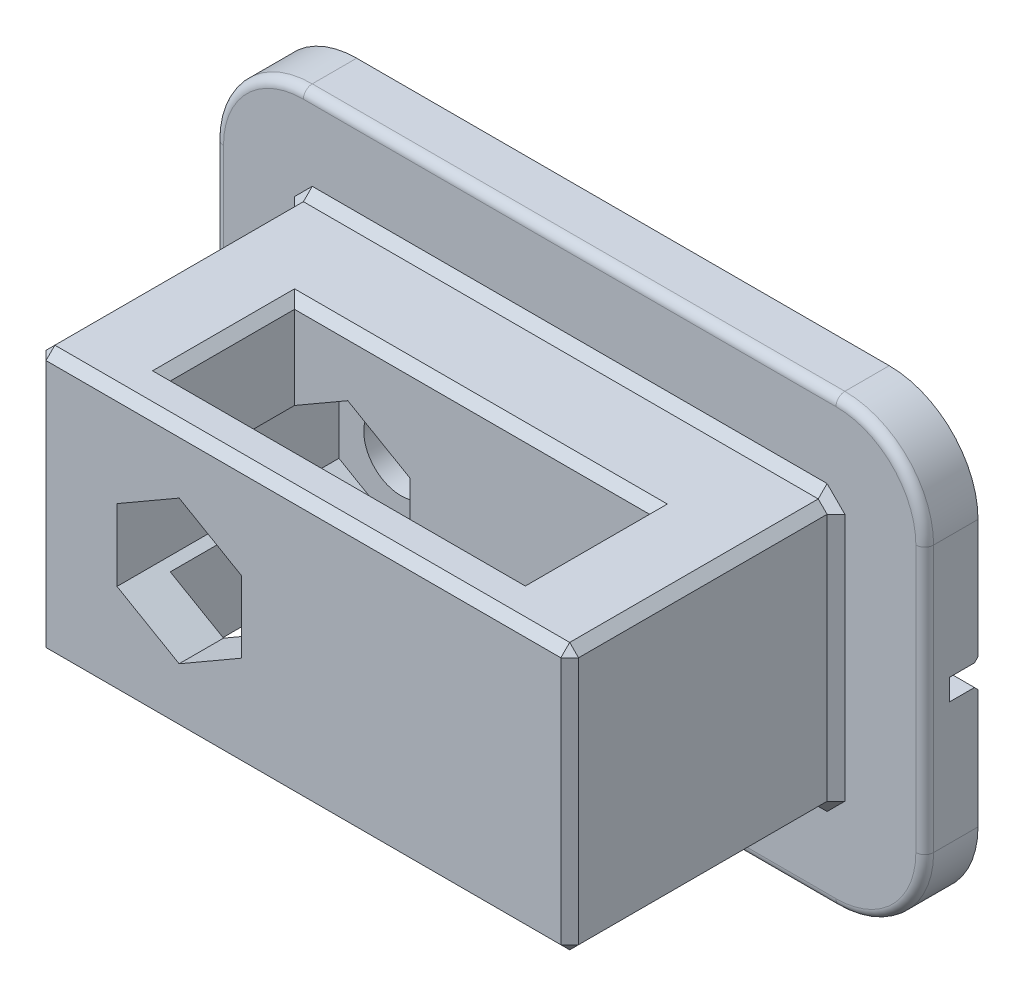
ISO-10303-21;
HEADER;
FILE_DESCRIPTION(('STEP AP214'),'2;1');
FILE_NAME('part.step','',(''),(''),'','','');
FILE_SCHEMA(('AUTOMOTIVE_DESIGN { 1 0 10303 214 1 1 1 1 }'));
ENDSEC;
DATA;
#1=APPLICATION_CONTEXT('core data for automotive mechanical design processes');
#2=APPLICATION_PROTOCOL_DEFINITION('international standard','automotive_design',2000,#1);
#3=PRODUCT_CONTEXT('',#1,'mechanical');
#4=PRODUCT('Part','Part','',(#3));
#5=PRODUCT_RELATED_PRODUCT_CATEGORY('part','',(#4));
#6=PRODUCT_DEFINITION_FORMATION('','',#4);
#7=PRODUCT_DEFINITION_CONTEXT('part definition',#1,'design');
#8=PRODUCT_DEFINITION('design','',#6,#7);
#9=PRODUCT_DEFINITION_SHAPE('','',#8);
#10=(LENGTH_UNIT() NAMED_UNIT(*) SI_UNIT(.MILLI.,.METRE.));
#11=(NAMED_UNIT(*) PLANE_ANGLE_UNIT() SI_UNIT($,.RADIAN.));
#12=(NAMED_UNIT(*) SI_UNIT($,.STERADIAN.) SOLID_ANGLE_UNIT());
#13=UNCERTAINTY_MEASURE_WITH_UNIT(LENGTH_MEASURE(1.E-05),#10,'distance_accuracy_value','');
#14=(GEOMETRIC_REPRESENTATION_CONTEXT(3) GLOBAL_UNCERTAINTY_ASSIGNED_CONTEXT((#13)) GLOBAL_UNIT_ASSIGNED_CONTEXT((#10,
#11,#12)) REPRESENTATION_CONTEXT('',''));
#15=CARTESIAN_POINT('',(0.,0.,0.));
#16=DIRECTION('',(0.,0.,1.));
#17=DIRECTION('',(1.,0.,0.));
#18=AXIS2_PLACEMENT_3D('',#15,#16,#17);
#19=CARTESIAN_POINT('',(35.,20.,0.));
#20=DIRECTION('',(0.,0.,-1.));
#21=DIRECTION('',(-1.,0.,0.));
#22=AXIS2_PLACEMENT_3D('',#19,#20,#21);
#23=PLANE('',#22);
#24=CARTESIAN_POINT('',(13.,12.5,0.));
#25=DIRECTION('',(0.,0.,1.));
#26=DIRECTION('',(1.,0.,0.));
#27=AXIS2_PLACEMENT_3D('',#24,#25,#26);
#28=CIRCLE('',#27,2.1);
#29=CARTESIAN_POINT('',(14.9416487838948,13.3,0.));
#30=VERTEX_POINT('',#29);
#31=CARTESIAN_POINT('',(11.0583512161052,13.3,0.));
#32=VERTEX_POINT('',#31);
#33=EDGE_CURVE('E670',#30,#32,#28,.T.);
#34=ORIENTED_EDGE('',*,*,#33,.T.);
#35=DIRECTION('',(-1.,0.,0.));
#36=VECTOR('',#35,1.);
#37=CARTESIAN_POINT('',(0.,13.3,0.));
#38=LINE('',#37,#36);
#39=CARTESIAN_POINT('',(0.,13.3,0.));
#40=VERTEX_POINT('',#39);
#41=EDGE_CURVE('E56',#32,#40,#38,.T.);
#42=ORIENTED_EDGE('',*,*,#41,.T.);
#43=DIRECTION('',(0.,-1.,0.));
#44=VECTOR('',#43,1.);
#45=CARTESIAN_POINT('',(0.,5.00000000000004,0.));
#46=LINE('',#45,#44);
#47=CARTESIAN_POINT('',(0.,20.,0.));
#48=VERTEX_POINT('',#47);
#49=EDGE_CURVE('E1273',#48,#40,#46,.T.);
#50=ORIENTED_EDGE('',*,*,#49,.F.);
#51=CARTESIAN_POINT('',(5.,20.,0.));
#52=DIRECTION('',(0.,0.,1.));
#53=DIRECTION('',(-1.,0.,0.));
#54=AXIS2_PLACEMENT_3D('',#51,#52,#53);
#55=CIRCLE('',#54,5.);
#56=CARTESIAN_POINT('',(5.00000000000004,25.,0.));
#57=VERTEX_POINT('',#56);
#58=EDGE_CURVE('E1168',#57,#48,#55,.T.);
#59=ORIENTED_EDGE('',*,*,#58,.F.);
#60=DIRECTION('',(-1.,0.,0.));
#61=VECTOR('',#60,1.);
#62=CARTESIAN_POINT('',(5.00000000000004,25.,0.));
#63=LINE('',#62,#61);
#64=CARTESIAN_POINT('',(35.,25.,0.));
#65=VERTEX_POINT('',#64);
#66=EDGE_CURVE('E1161',#65,#57,#63,.T.);
#67=ORIENTED_EDGE('',*,*,#66,.F.);
#68=CARTESIAN_POINT('',(35.,20.,0.));
#69=DIRECTION('',(0.,0.,1.));
#70=DIRECTION('',(-1.,0.,0.));
#71=AXIS2_PLACEMENT_3D('',#68,#69,#70);
#72=CIRCLE('',#71,5.);
#73=CARTESIAN_POINT('',(40.,20.,0.));
#74=VERTEX_POINT('',#73);
#75=EDGE_CURVE('E804',#74,#65,#72,.T.);
#76=ORIENTED_EDGE('',*,*,#75,.F.);
#77=DIRECTION('',(0.,1.,0.));
#78=VECTOR('',#77,1.);
#79=CARTESIAN_POINT('',(40.,5.00000000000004,0.));
#80=LINE('',#79,#78);
#81=CARTESIAN_POINT('',(40.,13.3,0.));
#82=VERTEX_POINT('',#81);
#83=EDGE_CURVE('E1138',#82,#74,#80,.T.);
#84=ORIENTED_EDGE('',*,*,#83,.F.);
#85=DIRECTION('',(-1.,0.,0.));
#86=VECTOR('',#85,1.);
#87=CARTESIAN_POINT('',(15.0124611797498,13.3,0.));
#88=LINE('',#87,#86);
#89=EDGE_CURVE('E895',#82,#30,#88,.T.);
#90=ORIENTED_EDGE('',*,*,#89,.T.);
#91=EDGE_LOOP('',(#34,#42,#50,#59,#67,#76,#84,#90));
#92=FACE_BOUND('',#91,.T.);
#93=ADVANCED_FACE('F45',(#92),#23,.T.);
#94=CARTESIAN_POINT('',(35.,20.,3.));
#95=DIRECTION('',(0.,0.,-1.));
#96=DIRECTION('',(-1.,0.,0.));
#97=AXIS2_PLACEMENT_3D('',#94,#95,#96);
#98=PLANE('',#97);
#99=DIRECTION('',(-1.,0.,0.));
#100=VECTOR('',#99,1.);
#101=CARTESIAN_POINT('',(35.,24.5,3.));
#102=LINE('',#101,#100);
#103=CARTESIAN_POINT('',(35.,24.5,3.));
#104=VERTEX_POINT('',#103);
#105=CARTESIAN_POINT('',(5.00000000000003,24.5,3.));
#106=VERTEX_POINT('',#105);
#107=EDGE_CURVE('E973',#104,#106,#102,.T.);
#108=ORIENTED_EDGE('',*,*,#107,.T.);
#109=CARTESIAN_POINT('',(5.,20.,3.));
#110=DIRECTION('',(0.,0.,-1.));
#111=DIRECTION('',(-1.,0.,0.));
#112=AXIS2_PLACEMENT_3D('',#109,#110,#111);
#113=CIRCLE('',#112,4.5);
#114=CARTESIAN_POINT('',(0.5,20.,3.));
#115=VERTEX_POINT('',#114);
#116=EDGE_CURVE('E978',#106,#115,#113,.F.);
#117=ORIENTED_EDGE('',*,*,#116,.T.);
#118=DIRECTION('',(0.,-1.,0.));
#119=VECTOR('',#118,1.);
#120=CARTESIAN_POINT('',(0.5,20.,3.));
#121=LINE('',#120,#119);
#122=CARTESIAN_POINT('',(0.5,5.00000000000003,3.));
#123=VERTEX_POINT('',#122);
#124=EDGE_CURVE('E1210',#115,#123,#121,.T.);
#125=ORIENTED_EDGE('',*,*,#124,.T.);
#126=CARTESIAN_POINT('',(5.,5.,3.));
#127=DIRECTION('',(0.,0.,-1.));
#128=DIRECTION('',(-1.,0.,0.));
#129=AXIS2_PLACEMENT_3D('',#126,#127,#128);
#130=CIRCLE('',#129,4.5);
#131=CARTESIAN_POINT('',(5.00000000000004,0.5,3.));
#132=VERTEX_POINT('',#131);
#133=EDGE_CURVE('E1851',#123,#132,#130,.F.);
#134=ORIENTED_EDGE('',*,*,#133,.T.);
#135=DIRECTION('',(1.,0.,0.));
#136=VECTOR('',#135,1.);
#137=CARTESIAN_POINT('',(35.,0.5,3.));
#138=LINE('',#137,#136);
#139=CARTESIAN_POINT('',(35.,0.5,3.));
#140=VERTEX_POINT('',#139);
#141=EDGE_CURVE('E2536',#132,#140,#138,.T.);
#142=ORIENTED_EDGE('',*,*,#141,.T.);
#143=CARTESIAN_POINT('',(35.,5.,3.));
#144=DIRECTION('',(0.,0.,-1.));
#145=DIRECTION('',(-1.,0.,0.));
#146=AXIS2_PLACEMENT_3D('',#143,#144,#145);
#147=CIRCLE('',#146,4.5);
#148=CARTESIAN_POINT('',(39.5,5.00000000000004,3.));
#149=VERTEX_POINT('',#148);
#150=EDGE_CURVE('E1859',#140,#149,#147,.F.);
#151=ORIENTED_EDGE('',*,*,#150,.T.);
#152=DIRECTION('',(0.,1.,0.));
#153=VECTOR('',#152,1.);
#154=CARTESIAN_POINT('',(39.5,20.,3.));
#155=LINE('',#154,#153);
#156=CARTESIAN_POINT('',(39.5,20.,3.));
#157=VERTEX_POINT('',#156);
#158=EDGE_CURVE('E1855',#149,#157,#155,.T.);
#159=ORIENTED_EDGE('',*,*,#158,.T.);
#160=CARTESIAN_POINT('',(35.,20.,3.));
#161=DIRECTION('',(0.,0.,-1.));
#162=DIRECTION('',(-1.,0.,0.));
#163=AXIS2_PLACEMENT_3D('',#160,#161,#162);
#164=CIRCLE('',#163,4.5);
#165=EDGE_CURVE('E979',#157,#104,#164,.F.);
#166=ORIENTED_EDGE('',*,*,#165,.T.);
#167=EDGE_LOOP('',(#108,#117,#125,#134,#142,#151,#159,#166));
#168=FACE_BOUND('',#167,.T.);
#169=DIRECTION('',(-0.707106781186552,-0.707106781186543,0.));
#170=VECTOR('',#169,1.);
#171=CARTESIAN_POINT('',(4.5,19.5,3.));
#172=LINE('',#171,#170);
#173=CARTESIAN_POINT('',(5.,20.,3.));
#174=VERTEX_POINT('',#173);
#175=CARTESIAN_POINT('',(4.5,19.5,3.));
#176=VERTEX_POINT('',#175);
#177=EDGE_CURVE('E932',#174,#176,#172,.T.);
#178=ORIENTED_EDGE('',*,*,#177,.F.);
#179=DIRECTION('',(-0.707106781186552,-0.707106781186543,0.));
#180=VECTOR('',#179,1.);
#181=CARTESIAN_POINT('',(4.5,19.5,3.));
#182=LINE('',#181,#180);
#183=CARTESIAN_POINT('',(5.50000000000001,20.5,3.));
#184=VERTEX_POINT('',#183);
#185=EDGE_CURVE('E999',#184,#174,#182,.T.);
#186=ORIENTED_EDGE('',*,*,#185,.F.);
#187=DIRECTION('',(1.,0.,0.));
#188=VECTOR('',#187,1.);
#189=CARTESIAN_POINT('',(35.,20.5,3.));
#190=LINE('',#189,#188);
#191=CARTESIAN_POINT('',(34.5,20.5,3.));
#192=VERTEX_POINT('',#191);
#193=EDGE_CURVE('E1014',#184,#192,#190,.T.);
#194=ORIENTED_EDGE('',*,*,#193,.T.);
#195=DIRECTION('',(-0.707106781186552,0.707106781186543,0.));
#196=VECTOR('',#195,1.);
#197=CARTESIAN_POINT('',(34.5,20.5,3.));
#198=LINE('',#197,#196);
#199=CARTESIAN_POINT('',(35.,20.,3.));
#200=VERTEX_POINT('',#199);
#201=EDGE_CURVE('E1018',#200,#192,#198,.T.);
#202=ORIENTED_EDGE('',*,*,#201,.F.);
#203=DIRECTION('',(-0.707106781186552,0.707106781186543,0.));
#204=VECTOR('',#203,1.);
#205=CARTESIAN_POINT('',(34.5,20.5,3.));
#206=LINE('',#205,#204);
#207=CARTESIAN_POINT('',(35.5,19.5,3.));
#208=VERTEX_POINT('',#207);
#209=EDGE_CURVE('E1033',#208,#200,#206,.T.);
#210=ORIENTED_EDGE('',*,*,#209,.F.);
#211=DIRECTION('',(0.,-1.,0.));
#212=VECTOR('',#211,1.);
#213=CARTESIAN_POINT('',(35.5,5.,3.));
#214=LINE('',#213,#212);
#215=CARTESIAN_POINT('',(35.5,5.5,3.));
#216=VERTEX_POINT('',#215);
#217=EDGE_CURVE('E1038',#208,#216,#214,.T.);
#218=ORIENTED_EDGE('',*,*,#217,.T.);
#219=DIRECTION('',(0.707106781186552,0.707106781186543,0.));
#220=VECTOR('',#219,1.);
#221=CARTESIAN_POINT('',(35.5,5.50000000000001,3.));
#222=LINE('',#221,#220);
#223=CARTESIAN_POINT('',(35.,5.,3.));
#224=VERTEX_POINT('',#223);
#225=EDGE_CURVE('E1042',#224,#216,#222,.T.);
#226=ORIENTED_EDGE('',*,*,#225,.F.);
#227=DIRECTION('',(0.707106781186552,0.707106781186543,0.));
#228=VECTOR('',#227,1.);
#229=CARTESIAN_POINT('',(35.5,5.50000000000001,3.));
#230=LINE('',#229,#228);
#231=CARTESIAN_POINT('',(34.5,4.5,3.));
#232=VERTEX_POINT('',#231);
#233=EDGE_CURVE('E1047',#232,#224,#230,.T.);
#234=ORIENTED_EDGE('',*,*,#233,.F.);
#235=DIRECTION('',(-1.,0.,0.));
#236=VECTOR('',#235,1.);
#237=CARTESIAN_POINT('',(5.,4.5,3.));
#238=LINE('',#237,#236);
#239=CARTESIAN_POINT('',(5.50000000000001,4.5,3.));
#240=VERTEX_POINT('',#239);
#241=EDGE_CURVE('E1028',#232,#240,#238,.T.);
#242=ORIENTED_EDGE('',*,*,#241,.T.);
#243=DIRECTION('',(0.707106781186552,-0.707106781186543,0.));
#244=VECTOR('',#243,1.);
#245=CARTESIAN_POINT('',(5.50000000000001,4.5,3.));
#246=LINE('',#245,#244);
#247=CARTESIAN_POINT('',(5.,5.,3.));
#248=VERTEX_POINT('',#247);
#249=EDGE_CURVE('E1017',#248,#240,#246,.T.);
#250=ORIENTED_EDGE('',*,*,#249,.F.);
#251=DIRECTION('',(0.707106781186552,-0.707106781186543,0.));
#252=VECTOR('',#251,1.);
#253=CARTESIAN_POINT('',(5.50000000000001,4.5,3.));
#254=LINE('',#253,#252);
#255=CARTESIAN_POINT('',(4.5,5.5,3.));
#256=VERTEX_POINT('',#255);
#257=EDGE_CURVE('E1003',#256,#248,#254,.T.);
#258=ORIENTED_EDGE('',*,*,#257,.F.);
#259=DIRECTION('',(0.,1.,0.));
#260=VECTOR('',#259,1.);
#261=CARTESIAN_POINT('',(4.5,20.,3.));
#262=LINE('',#261,#260);
#263=EDGE_CURVE('E995',#256,#176,#262,.T.);
#264=ORIENTED_EDGE('',*,*,#263,.T.);
#265=EDGE_LOOP('',(#178,#186,#194,#202,#210,#218,#226,#234,#242,#250,#258,#264));
#266=FACE_BOUND('',#265,.T.);
#267=ADVANCED_FACE('F1060',(#168,#266),#98,.F.);
#268=CARTESIAN_POINT('',(9.99999999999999,0.,8.5));
#269=DIRECTION('',(-1.,0.,0.));
#270=DIRECTION('',(0.,-1.,0.));
#271=AXIS2_PLACEMENT_3D('',#268,#269,#270);
#272=PLANE('',#271);
#273=DIRECTION('',(0.,1.,0.));
#274=VECTOR('',#273,1.);
#275=CARTESIAN_POINT('',(9.99999999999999,0.,15.5));
#276=LINE('',#275,#274);
#277=CARTESIAN_POINT('',(9.99999999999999,5.5,15.5));
#278=VERTEX_POINT('',#277);
#279=CARTESIAN_POINT('',(9.99999999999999,10.1905989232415,15.5));
#280=VERTEX_POINT('',#279);
#281=EDGE_CURVE('E1162',#278,#280,#276,.T.);
#282=ORIENTED_EDGE('',*,*,#281,.F.);
#283=DIRECTION('',(0.,0.,-1.));
#284=VECTOR('',#283,1.);
#285=CARTESIAN_POINT('',(9.99999999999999,5.5,8.5));
#286=LINE('',#285,#284);
#287=CARTESIAN_POINT('',(9.99999999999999,5.5,8.5));
#288=VERTEX_POINT('',#287);
#289=EDGE_CURVE('E823',#278,#288,#286,.T.);
#290=ORIENTED_EDGE('',*,*,#289,.T.);
#291=DIRECTION('',(0.,1.,0.));
#292=VECTOR('',#291,1.);
#293=CARTESIAN_POINT('',(9.99999999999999,0.,8.5));
#294=LINE('',#293,#292);
#295=CARTESIAN_POINT('',(9.99999999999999,10.1905989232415,8.5));
#296=VERTEX_POINT('',#295);
#297=EDGE_CURVE('E800',#288,#296,#294,.T.);
#298=ORIENTED_EDGE('',*,*,#297,.T.);
#299=DIRECTION('',(0.,0.,1.));
#300=VECTOR('',#299,1.);
#301=CARTESIAN_POINT('',(9.99999999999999,10.1905989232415,8.5));
#302=LINE('',#301,#300);
#303=EDGE_CURVE('E780',#296,#280,#302,.T.);
#304=ORIENTED_EDGE('',*,*,#303,.T.);
#305=EDGE_LOOP('',(#282,#290,#298,#304));
#306=FACE_BOUND('',#305,.T.);
#307=ADVANCED_FACE('F1089',(#306),#272,.F.);
#308=CARTESIAN_POINT('',(35.,20.,3.));
#309=DIRECTION('',(0.,0.,-1.));
#310=DIRECTION('',(-1.,0.,0.));
#311=AXIS2_PLACEMENT_3D('',#308,#309,#310);
#312=CYLINDRICAL_SURFACE('',#311,5.);
#313=DIRECTION('',(0.,0.,-1.));
#314=VECTOR('',#313,1.);
#315=CARTESIAN_POINT('',(35.,25.,3.));
#316=LINE('',#315,#314);
#317=CARTESIAN_POINT('',(35.,25.,2.5));
#318=VERTEX_POINT('',#317);
#319=EDGE_CURVE('E1176',#318,#65,#316,.T.);
#320=ORIENTED_EDGE('',*,*,#319,.F.);
#321=CARTESIAN_POINT('',(35.,20.,2.5));
#322=DIRECTION('',(0.,0.,-1.));
#323=DIRECTION('',(-1.,0.,0.));
#324=AXIS2_PLACEMENT_3D('',#321,#322,#323);
#325=CIRCLE('',#324,5.);
#326=CARTESIAN_POINT('',(40.,20.,2.5));
#327=VERTEX_POINT('',#326);
#328=EDGE_CURVE('E1724',#318,#327,#325,.T.);
#329=ORIENTED_EDGE('',*,*,#328,.T.);
#330=DIRECTION('',(0.,0.,-1.));
#331=VECTOR('',#330,1.);
#332=CARTESIAN_POINT('',(40.,20.,3.));
#333=LINE('',#332,#331);
#334=EDGE_CURVE('E1137',#327,#74,#333,.T.);
#335=ORIENTED_EDGE('',*,*,#334,.T.);
#336=ORIENTED_EDGE('',*,*,#75,.T.);
#337=EDGE_LOOP('',(#320,#329,#335,#336));
#338=FACE_BOUND('',#337,.T.);
#339=ADVANCED_FACE('F1583',(#338),#312,.T.);
#340=CARTESIAN_POINT('',(5.00000000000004,25.,3.));
#341=DIRECTION('',(0.,-1.,0.));
#342=DIRECTION('',(0.,0.,-1.));
#343=AXIS2_PLACEMENT_3D('',#340,#341,#342);
#344=PLANE('',#343);
#345=DIRECTION('',(0.,0.,-1.));
#346=VECTOR('',#345,1.);
#347=CARTESIAN_POINT('',(5.00000000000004,25.,3.));
#348=LINE('',#347,#346);
#349=CARTESIAN_POINT('',(5.00000000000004,25.,2.5));
#350=VERTEX_POINT('',#349);
#351=EDGE_CURVE('E1181',#350,#57,#348,.T.);
#352=ORIENTED_EDGE('',*,*,#351,.F.);
#353=DIRECTION('',(-1.,0.,0.));
#354=VECTOR('',#353,1.);
#355=CARTESIAN_POINT('',(5.00000000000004,25.,2.5));
#356=LINE('',#355,#354);
#357=EDGE_CURVE('E989',#350,#318,#356,.F.);
#358=ORIENTED_EDGE('',*,*,#357,.T.);
#359=ORIENTED_EDGE('',*,*,#319,.T.);
#360=ORIENTED_EDGE('',*,*,#66,.T.);
#361=EDGE_LOOP('',(#352,#358,#359,#360));
#362=FACE_BOUND('',#361,.T.);
#363=ADVANCED_FACE('F1574',(#362),#344,.F.);
#364=CARTESIAN_POINT('',(5.,20.,3.));
#365=DIRECTION('',(0.,0.,-1.));
#366=DIRECTION('',(-1.,0.,0.));
#367=AXIS2_PLACEMENT_3D('',#364,#365,#366);
#368=CYLINDRICAL_SURFACE('',#367,5.);
#369=DIRECTION('',(0.,0.,-1.));
#370=VECTOR('',#369,1.);
#371=CARTESIAN_POINT('',(0.,20.,3.));
#372=LINE('',#371,#370);
#373=CARTESIAN_POINT('',(0.,20.,2.5));
#374=VERTEX_POINT('',#373);
#375=EDGE_CURVE('E1726',#374,#48,#372,.T.);
#376=ORIENTED_EDGE('',*,*,#375,.F.);
#377=CARTESIAN_POINT('',(5.,20.,2.5));
#378=DIRECTION('',(0.,0.,-1.));
#379=DIRECTION('',(-1.,0.,0.));
#380=AXIS2_PLACEMENT_3D('',#377,#378,#379);
#381=CIRCLE('',#380,5.);
#382=EDGE_CURVE('E984',#374,#350,#381,.T.);
#383=ORIENTED_EDGE('',*,*,#382,.T.);
#384=ORIENTED_EDGE('',*,*,#351,.T.);
#385=ORIENTED_EDGE('',*,*,#58,.T.);
#386=EDGE_LOOP('',(#376,#383,#384,#385));
#387=FACE_BOUND('',#386,.T.);
#388=ADVANCED_FACE('F1570',(#387),#368,.T.);
#389=CARTESIAN_POINT('',(0.,5.00000000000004,3.));
#390=DIRECTION('',(1.,0.,0.));
#391=DIRECTION('',(0.,0.,-1.));
#392=AXIS2_PLACEMENT_3D('',#389,#390,#391);
#393=PLANE('',#392);
#394=DIRECTION('',(0.,0.,-1.));
#395=VECTOR('',#394,1.);
#396=CARTESIAN_POINT('',(0.,11.9,3.));
#397=LINE('',#396,#395);
#398=CARTESIAN_POINT('',(0.,11.9,1.6));
#399=VERTEX_POINT('',#398);
#400=CARTESIAN_POINT('',(0.,11.9,0.199999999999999));
#401=VERTEX_POINT('',#400);
#402=EDGE_CURVE('E1262',#399,#401,#397,.T.);
#403=ORIENTED_EDGE('',*,*,#402,.T.);
#404=DIRECTION('',(0.,-0.707106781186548,-0.707106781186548));
#405=VECTOR('',#404,1.);
#406=CARTESIAN_POINT('',(0.,11.9,0.199999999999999));
#407=LINE('',#406,#405);
#408=CARTESIAN_POINT('',(0.,11.7,0.));
#409=VERTEX_POINT('',#408);
#410=EDGE_CURVE('E650',#401,#409,#407,.T.);
#411=ORIENTED_EDGE('',*,*,#410,.T.);
#412=CARTESIAN_POINT('',(0.,5.00000000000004,0.));
#413=VERTEX_POINT('',#412);
#414=EDGE_CURVE('E1278',#409,#413,#46,.T.);
#415=ORIENTED_EDGE('',*,*,#414,.T.);
#416=DIRECTION('',(0.,0.,-1.));
#417=VECTOR('',#416,1.);
#418=CARTESIAN_POINT('',(0.,5.00000000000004,3.));
#419=LINE('',#418,#417);
#420=CARTESIAN_POINT('',(0.,5.00000000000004,2.5));
#421=VERTEX_POINT('',#420);
#422=EDGE_CURVE('E1730',#421,#413,#419,.T.);
#423=ORIENTED_EDGE('',*,*,#422,.F.);
#424=DIRECTION('',(0.,-1.,0.));
#425=VECTOR('',#424,1.);
#426=CARTESIAN_POINT('',(0.,5.00000000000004,2.5));
#427=LINE('',#426,#425);
#428=EDGE_CURVE('E743',#421,#374,#427,.F.);
#429=ORIENTED_EDGE('',*,*,#428,.T.);
#430=ORIENTED_EDGE('',*,*,#375,.T.);
#431=ORIENTED_EDGE('',*,*,#49,.T.);
#432=DIRECTION('',(0.,-0.707106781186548,0.707106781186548));
#433=VECTOR('',#432,1.);
#434=CARTESIAN_POINT('',(0.,13.1,0.199999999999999));
#435=LINE('',#434,#433);
#436=CARTESIAN_POINT('',(0.,13.1,0.199999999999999));
#437=VERTEX_POINT('',#436);
#438=EDGE_CURVE('E66',#40,#437,#435,.T.);
#439=ORIENTED_EDGE('',*,*,#438,.T.);
#440=DIRECTION('',(0.,0.,1.));
#441=VECTOR('',#440,1.);
#442=CARTESIAN_POINT('',(0.,13.1,3.));
#443=LINE('',#442,#441);
#444=CARTESIAN_POINT('',(0.,13.1,1.6));
#445=VERTEX_POINT('',#444);
#446=EDGE_CURVE('E544',#437,#445,#443,.T.);
#447=ORIENTED_EDGE('',*,*,#446,.T.);
#448=DIRECTION('',(0.,1.,0.));
#449=VECTOR('',#448,1.);
#450=CARTESIAN_POINT('',(0.,5.00000000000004,1.6));
#451=LINE('',#450,#449);
#452=EDGE_CURVE('E548',#399,#445,#451,.T.);
#453=ORIENTED_EDGE('',*,*,#452,.F.);
#454=EDGE_LOOP('',(#403,#411,#415,#423,#429,#430,#431,#439,#447,#453));
#455=FACE_BOUND('',#454,.T.);
#456=ADVANCED_FACE('F547',(#455),#393,.F.);
#457=CARTESIAN_POINT('',(5.,5.,3.));
#458=DIRECTION('',(0.,0.,-1.));
#459=DIRECTION('',(-1.,0.,0.));
#460=AXIS2_PLACEMENT_3D('',#457,#458,#459);
#461=CYLINDRICAL_SURFACE('',#460,5.);
#462=DIRECTION('',(0.,0.,-1.));
#463=VECTOR('',#462,1.);
#464=CARTESIAN_POINT('',(5.00000000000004,0.,3.));
#465=LINE('',#464,#463);
#466=CARTESIAN_POINT('',(5.00000000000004,0.,2.5));
#467=VERTEX_POINT('',#466);
#468=CARTESIAN_POINT('',(5.00000000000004,0.,0.));
#469=VERTEX_POINT('',#468);
#470=EDGE_CURVE('E1732',#467,#469,#465,.T.);
#471=ORIENTED_EDGE('',*,*,#470,.F.);
#472=CARTESIAN_POINT('',(5.,5.,2.5));
#473=DIRECTION('',(0.,0.,-1.));
#474=DIRECTION('',(-1.,0.,0.));
#475=AXIS2_PLACEMENT_3D('',#472,#473,#474);
#476=CIRCLE('',#475,5.);
#477=EDGE_CURVE('E745',#467,#421,#476,.T.);
#478=ORIENTED_EDGE('',*,*,#477,.T.);
#479=ORIENTED_EDGE('',*,*,#422,.T.);
#480=CARTESIAN_POINT('',(5.,5.,0.));
#481=DIRECTION('',(0.,0.,1.));
#482=DIRECTION('',(-1.,0.,0.));
#483=AXIS2_PLACEMENT_3D('',#480,#481,#482);
#484=CIRCLE('',#483,5.);
#485=EDGE_CURVE('E1277',#413,#469,#484,.T.);
#486=ORIENTED_EDGE('',*,*,#485,.T.);
#487=EDGE_LOOP('',(#471,#478,#479,#486));
#488=FACE_BOUND('',#487,.T.);
#489=ADVANCED_FACE('F2470',(#488),#461,.T.);
#490=CARTESIAN_POINT('',(5.00000000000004,0.,3.));
#491=DIRECTION('',(0.,1.,0.));
#492=DIRECTION('',(0.,0.,1.));
#493=AXIS2_PLACEMENT_3D('',#490,#491,#492);
#494=PLANE('',#493);
#495=DIRECTION('',(0.,0.,-1.));
#496=VECTOR('',#495,1.);
#497=CARTESIAN_POINT('',(35.,0.,3.));
#498=LINE('',#497,#496);
#499=CARTESIAN_POINT('',(35.,0.,2.5));
#500=VERTEX_POINT('',#499);
#501=CARTESIAN_POINT('',(35.,0.,0.));
#502=VERTEX_POINT('',#501);
#503=EDGE_CURVE('E1737',#500,#502,#498,.T.);
#504=ORIENTED_EDGE('',*,*,#503,.F.);
#505=DIRECTION('',(1.,0.,0.));
#506=VECTOR('',#505,1.);
#507=CARTESIAN_POINT('',(5.00000000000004,0.,2.5));
#508=LINE('',#507,#506);
#509=EDGE_CURVE('E752',#500,#467,#508,.F.);
#510=ORIENTED_EDGE('',*,*,#509,.T.);
#511=ORIENTED_EDGE('',*,*,#470,.T.);
#512=DIRECTION('',(1.,0.,0.));
#513=VECTOR('',#512,1.);
#514=CARTESIAN_POINT('',(5.00000000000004,0.,0.));
#515=LINE('',#514,#513);
#516=EDGE_CURVE('E1283',#469,#502,#515,.T.);
#517=ORIENTED_EDGE('',*,*,#516,.T.);
#518=EDGE_LOOP('',(#504,#510,#511,#517));
#519=FACE_BOUND('',#518,.T.);
#520=ADVANCED_FACE('F2460',(#519),#494,.F.);
#521=CARTESIAN_POINT('',(35.,5.,3.));
#522=DIRECTION('',(0.,0.,-1.));
#523=DIRECTION('',(-1.,0.,0.));
#524=AXIS2_PLACEMENT_3D('',#521,#522,#523);
#525=CYLINDRICAL_SURFACE('',#524,5.);
#526=DIRECTION('',(0.,0.,-1.));
#527=VECTOR('',#526,1.);
#528=CARTESIAN_POINT('',(40.,5.00000000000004,3.));
#529=LINE('',#528,#527);
#530=CARTESIAN_POINT('',(40.,5.00000000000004,2.5));
#531=VERTEX_POINT('',#530);
#532=CARTESIAN_POINT('',(40.,5.00000000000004,0.));
#533=VERTEX_POINT('',#532);
#534=EDGE_CURVE('E1147',#531,#533,#529,.T.);
#535=ORIENTED_EDGE('',*,*,#534,.F.);
#536=CARTESIAN_POINT('',(35.,5.,2.5));
#537=DIRECTION('',(0.,0.,-1.));
#538=DIRECTION('',(-1.,0.,0.));
#539=AXIS2_PLACEMENT_3D('',#536,#537,#538);
#540=CIRCLE('',#539,5.);
#541=EDGE_CURVE('E1860',#531,#500,#540,.T.);
#542=ORIENTED_EDGE('',*,*,#541,.T.);
#543=ORIENTED_EDGE('',*,*,#503,.T.);
#544=CARTESIAN_POINT('',(35.,5.,0.));
#545=DIRECTION('',(0.,0.,1.));
#546=DIRECTION('',(-1.,0.,0.));
#547=AXIS2_PLACEMENT_3D('',#544,#545,#546);
#548=CIRCLE('',#547,5.);
#549=EDGE_CURVE('E1139',#502,#533,#548,.T.);
#550=ORIENTED_EDGE('',*,*,#549,.T.);
#551=EDGE_LOOP('',(#535,#542,#543,#550));
#552=FACE_BOUND('',#551,.T.);
#553=ADVANCED_FACE('F1105',(#552),#525,.T.);
#554=CARTESIAN_POINT('',(40.,5.00000000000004,3.));
#555=DIRECTION('',(-1.,0.,0.));
#556=DIRECTION('',(0.,0.,1.));
#557=AXIS2_PLACEMENT_3D('',#554,#555,#556);
#558=PLANE('',#557);
#559=CARTESIAN_POINT('',(40.,11.7,0.));
#560=VERTEX_POINT('',#559);
#561=EDGE_CURVE('E1133',#533,#560,#80,.T.);
#562=ORIENTED_EDGE('',*,*,#561,.T.);
#563=DIRECTION('',(0.,0.707106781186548,0.707106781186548));
#564=VECTOR('',#563,1.);
#565=CARTESIAN_POINT('',(40.,11.9,0.199999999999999));
#566=LINE('',#565,#564);
#567=CARTESIAN_POINT('',(40.,11.9,0.199999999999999));
#568=VERTEX_POINT('',#567);
#569=EDGE_CURVE('E644',#560,#568,#566,.T.);
#570=ORIENTED_EDGE('',*,*,#569,.T.);
#571=DIRECTION('',(0.,0.,1.));
#572=VECTOR('',#571,1.);
#573=CARTESIAN_POINT('',(40.,11.9,3.));
#574=LINE('',#573,#572);
#575=CARTESIAN_POINT('',(40.,11.9,1.6));
#576=VERTEX_POINT('',#575);
#577=EDGE_CURVE('E566',#568,#576,#574,.T.);
#578=ORIENTED_EDGE('',*,*,#577,.T.);
#579=DIRECTION('',(0.,-1.,0.));
#580=VECTOR('',#579,1.);
#581=CARTESIAN_POINT('',(40.,5.00000000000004,1.6));
#582=LINE('',#581,#580);
#583=CARTESIAN_POINT('',(40.,13.1,1.6));
#584=VERTEX_POINT('',#583);
#585=EDGE_CURVE('E567',#584,#576,#582,.T.);
#586=ORIENTED_EDGE('',*,*,#585,.F.);
#587=DIRECTION('',(0.,0.,-1.));
#588=VECTOR('',#587,1.);
#589=CARTESIAN_POINT('',(40.,13.1,3.));
#590=LINE('',#589,#588);
#591=CARTESIAN_POINT('',(40.,13.1,0.199999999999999));
#592=VERTEX_POINT('',#591);
#593=EDGE_CURVE('E555',#584,#592,#590,.T.);
#594=ORIENTED_EDGE('',*,*,#593,.T.);
#595=DIRECTION('',(0.,0.707106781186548,-0.707106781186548));
#596=VECTOR('',#595,1.);
#597=CARTESIAN_POINT('',(40.,13.1,0.199999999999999));
#598=LINE('',#597,#596);
#599=EDGE_CURVE('E1117',#592,#82,#598,.T.);
#600=ORIENTED_EDGE('',*,*,#599,.T.);
#601=ORIENTED_EDGE('',*,*,#83,.T.);
#602=ORIENTED_EDGE('',*,*,#334,.F.);
#603=DIRECTION('',(0.,1.,0.));
#604=VECTOR('',#603,1.);
#605=CARTESIAN_POINT('',(40.,5.00000000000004,2.5));
#606=LINE('',#605,#604);
#607=EDGE_CURVE('E1861',#327,#531,#606,.F.);
#608=ORIENTED_EDGE('',*,*,#607,.T.);
#609=ORIENTED_EDGE('',*,*,#534,.T.);
#610=EDGE_LOOP('',(#562,#570,#578,#586,#594,#600,#601,#602,#608,#609));
#611=FACE_BOUND('',#610,.T.);
#612=ADVANCED_FACE('F1096',(#611),#558,.F.);
#613=CARTESIAN_POINT('',(11.0583512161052,11.7,0.));
#614=VERTEX_POINT('',#613);
#615=CARTESIAN_POINT('',(14.9416487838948,11.7,0.));
#616=VERTEX_POINT('',#615);
#617=EDGE_CURVE('E665',#614,#616,#28,.T.);
#618=ORIENTED_EDGE('',*,*,#617,.T.);
#619=DIRECTION('',(1.,0.,0.));
#620=VECTOR('',#619,1.);
#621=CARTESIAN_POINT('',(40.,11.7,0.));
#622=LINE('',#621,#620);
#623=EDGE_CURVE('E1109',#616,#560,#622,.T.);
#624=ORIENTED_EDGE('',*,*,#623,.T.);
#625=ORIENTED_EDGE('',*,*,#561,.F.);
#626=ORIENTED_EDGE('',*,*,#549,.F.);
#627=ORIENTED_EDGE('',*,*,#516,.F.);
#628=ORIENTED_EDGE('',*,*,#485,.F.);
#629=ORIENTED_EDGE('',*,*,#414,.F.);
#630=DIRECTION('',(1.,0.,0.));
#631=VECTOR('',#630,1.);
#632=CARTESIAN_POINT('',(10.9875388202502,11.7,0.));
#633=LINE('',#632,#631);
#634=EDGE_CURVE('E1113',#409,#614,#633,.T.);
#635=ORIENTED_EDGE('',*,*,#634,.T.);
#636=EDGE_LOOP('',(#618,#624,#625,#626,#627,#628,#629,#635));
#637=FACE_BOUND('',#636,.T.);
#638=ADVANCED_FACE('F1085',(#637),#23,.T.);
#639=CARTESIAN_POINT('',(5.,20.,18.));
#640=DIRECTION('',(1.,0.,0.));
#641=DIRECTION('',(0.,1.,0.));
#642=AXIS2_PLACEMENT_3D('',#639,#640,#641);
#643=PLANE('',#642);
#644=DIRECTION('',(0.,0.,-1.));
#645=VECTOR('',#644,1.);
#646=CARTESIAN_POINT('',(5.,19.5,18.));
#647=LINE('',#646,#645);
#648=CARTESIAN_POINT('',(5.,19.5,17.5));
#649=VERTEX_POINT('',#648);
#650=CARTESIAN_POINT('',(5.,19.5,3.50000000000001));
#651=VERTEX_POINT('',#650);
#652=EDGE_CURVE('E931',#649,#651,#647,.T.);
#653=ORIENTED_EDGE('',*,*,#652,.T.);
#654=DIRECTION('',(0.,-1.,0.));
#655=VECTOR('',#654,1.);
#656=CARTESIAN_POINT('',(5.,5.,3.50000000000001));
#657=LINE('',#656,#655);
#658=CARTESIAN_POINT('',(5.,5.5,3.50000000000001));
#659=VERTEX_POINT('',#658);
#660=EDGE_CURVE('E942',#651,#659,#657,.T.);
#661=ORIENTED_EDGE('',*,*,#660,.T.);
#662=DIRECTION('',(0.,0.,1.));
#663=VECTOR('',#662,1.);
#664=CARTESIAN_POINT('',(5.,5.5,18.));
#665=LINE('',#664,#663);
#666=CARTESIAN_POINT('',(5.,5.5,17.5));
#667=VERTEX_POINT('',#666);
#668=EDGE_CURVE('E938',#659,#667,#665,.T.);
#669=ORIENTED_EDGE('',*,*,#668,.T.);
#670=DIRECTION('',(0.,1.,0.));
#671=VECTOR('',#670,1.);
#672=CARTESIAN_POINT('',(5.,20.,17.5));
#673=LINE('',#672,#671);
#674=EDGE_CURVE('E927',#667,#649,#673,.T.);
#675=ORIENTED_EDGE('',*,*,#674,.T.);
#676=EDGE_LOOP('',(#653,#661,#669,#675));
#677=FACE_BOUND('',#676,.T.);
#678=ADVANCED_FACE('F1095',(#677),#643,.F.);
#679=CARTESIAN_POINT('',(5.,5.,18.));
#680=DIRECTION('',(0.,1.,0.));
#681=DIRECTION('',(0.,0.,1.));
#682=AXIS2_PLACEMENT_3D('',#679,#680,#681);
#683=PLANE('',#682);
#684=DIRECTION('',(0.,0.,-1.));
#685=VECTOR('',#684,1.);
#686=CARTESIAN_POINT('',(30.5,5.,18.));
#687=LINE('',#686,#685);
#688=CARTESIAN_POINT('',(30.5,5.,16.));
#689=VERTEX_POINT('',#688);
#690=CARTESIAN_POINT('',(30.5,5.,8.));
#691=VERTEX_POINT('',#690);
#692=EDGE_CURVE('E960',#689,#691,#687,.T.);
#693=ORIENTED_EDGE('',*,*,#692,.T.);
#694=DIRECTION('',(-1.,0.,0.));
#695=VECTOR('',#694,1.);
#696=CARTESIAN_POINT('',(5.,5.,8.));
#697=LINE('',#696,#695);
#698=CARTESIAN_POINT('',(9.49999999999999,5.,8.));
#699=VERTEX_POINT('',#698);
#700=EDGE_CURVE('E952',#691,#699,#697,.T.);
#701=ORIENTED_EDGE('',*,*,#700,.T.);
#702=DIRECTION('',(0.,0.,1.));
#703=VECTOR('',#702,1.);
#704=CARTESIAN_POINT('',(9.49999999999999,5.,18.));
#705=LINE('',#704,#703);
#706=CARTESIAN_POINT('',(9.49999999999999,5.,16.));
#707=VERTEX_POINT('',#706);
#708=EDGE_CURVE('E956',#699,#707,#705,.T.);
#709=ORIENTED_EDGE('',*,*,#708,.T.);
#710=DIRECTION('',(1.,0.,0.));
#711=VECTOR('',#710,1.);
#712=CARTESIAN_POINT('',(5.,5.,16.));
#713=LINE('',#712,#711);
#714=EDGE_CURVE('E964',#707,#689,#713,.T.);
#715=ORIENTED_EDGE('',*,*,#714,.T.);
#716=EDGE_LOOP('',(#693,#701,#709,#715));
#717=FACE_BOUND('',#716,.T.);
#718=DIRECTION('',(0.,0.,-1.));
#719=VECTOR('',#718,1.);
#720=CARTESIAN_POINT('',(5.50000000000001,5.,18.));
#721=LINE('',#720,#719);
#722=CARTESIAN_POINT('',(5.50000000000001,5.,17.5));
#723=VERTEX_POINT('',#722);
#724=CARTESIAN_POINT('',(5.50000000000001,5.,3.50000000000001));
#725=VERTEX_POINT('',#724);
#726=EDGE_CURVE('E1343',#723,#725,#721,.T.);
#727=ORIENTED_EDGE('',*,*,#726,.T.);
#728=DIRECTION('',(1.,0.,0.));
#729=VECTOR('',#728,1.);
#730=CARTESIAN_POINT('',(35.,5.,3.50000000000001));
#731=LINE('',#730,#729);
#732=CARTESIAN_POINT('',(34.5,5.,3.50000000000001));
#733=VERTEX_POINT('',#732);
#734=EDGE_CURVE('E1341',#725,#733,#731,.T.);
#735=ORIENTED_EDGE('',*,*,#734,.T.);
#736=DIRECTION('',(0.,0.,1.));
#737=VECTOR('',#736,1.);
#738=CARTESIAN_POINT('',(34.5,5.,18.));
#739=LINE('',#738,#737);
#740=CARTESIAN_POINT('',(34.5,5.,17.5));
#741=VERTEX_POINT('',#740);
#742=EDGE_CURVE('E1430',#733,#741,#739,.T.);
#743=ORIENTED_EDGE('',*,*,#742,.T.);
#744=DIRECTION('',(-1.,0.,0.));
#745=VECTOR('',#744,1.);
#746=CARTESIAN_POINT('',(5.,5.,17.5));
#747=LINE('',#746,#745);
#748=EDGE_CURVE('E1435',#741,#723,#747,.T.);
#749=ORIENTED_EDGE('',*,*,#748,.T.);
#750=EDGE_LOOP('',(#727,#735,#743,#749));
#751=FACE_BOUND('',#750,.T.);
#752=ADVANCED_FACE('F1102',(#717,#751),#683,.F.);
#753=CARTESIAN_POINT('',(35.,20.,18.));
#754=DIRECTION('',(-1.,0.,0.));
#755=DIRECTION('',(0.,-1.,0.));
#756=AXIS2_PLACEMENT_3D('',#753,#754,#755);
#757=PLANE('',#756);
#758=DIRECTION('',(0.,0.,-1.));
#759=VECTOR('',#758,1.);
#760=CARTESIAN_POINT('',(35.,5.5,18.));
#761=LINE('',#760,#759);
#762=CARTESIAN_POINT('',(35.,5.5,17.5));
#763=VERTEX_POINT('',#762);
#764=CARTESIAN_POINT('',(35.,5.5,3.5));
#765=VERTEX_POINT('',#764);
#766=EDGE_CURVE('E1200',#763,#765,#761,.T.);
#767=ORIENTED_EDGE('',*,*,#766,.T.);
#768=DIRECTION('',(0.,1.,0.));
#769=VECTOR('',#768,1.);
#770=CARTESIAN_POINT('',(35.,20.,3.5));
#771=LINE('',#770,#769);
#772=CARTESIAN_POINT('',(35.,19.5,3.5));
#773=VERTEX_POINT('',#772);
#774=EDGE_CURVE('E1066',#765,#773,#771,.T.);
#775=ORIENTED_EDGE('',*,*,#774,.T.);
#776=DIRECTION('',(0.,0.,1.));
#777=VECTOR('',#776,1.);
#778=CARTESIAN_POINT('',(35.,19.5,18.));
#779=LINE('',#778,#777);
#780=CARTESIAN_POINT('',(35.,19.5,17.5));
#781=VERTEX_POINT('',#780);
#782=EDGE_CURVE('E1392',#773,#781,#779,.T.);
#783=ORIENTED_EDGE('',*,*,#782,.T.);
#784=DIRECTION('',(0.,-1.,0.));
#785=VECTOR('',#784,1.);
#786=CARTESIAN_POINT('',(35.,5.,17.5));
#787=LINE('',#786,#785);
#788=EDGE_CURVE('E1204',#781,#763,#787,.T.);
#789=ORIENTED_EDGE('',*,*,#788,.T.);
#790=EDGE_LOOP('',(#767,#775,#783,#789));
#791=FACE_BOUND('',#790,.T.);
#792=ADVANCED_FACE('F1539',(#791),#757,.F.);
#793=CARTESIAN_POINT('',(5.,20.,18.));
#794=DIRECTION('',(0.,-1.,0.));
#795=DIRECTION('',(1.,0.,0.));
#796=AXIS2_PLACEMENT_3D('',#793,#794,#795);
#797=PLANE('',#796);
#798=DIRECTION('',(1.,0.,0.));
#799=VECTOR('',#798,1.);
#800=CARTESIAN_POINT('',(5.,20.,7.99999999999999));
#801=LINE('',#800,#799);
#802=CARTESIAN_POINT('',(9.49999999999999,20.,7.99999999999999));
#803=VERTEX_POINT('',#802);
#804=CARTESIAN_POINT('',(30.5,20.,7.99999999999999));
#805=VERTEX_POINT('',#804);
#806=EDGE_CURVE('E1296',#803,#805,#801,.T.);
#807=ORIENTED_EDGE('',*,*,#806,.T.);
#808=DIRECTION('',(0.,0.,1.));
#809=VECTOR('',#808,1.);
#810=CARTESIAN_POINT('',(30.5,20.,18.));
#811=LINE('',#810,#809);
#812=CARTESIAN_POINT('',(30.5,20.,16.));
#813=VERTEX_POINT('',#812);
#814=EDGE_CURVE('E1300',#805,#813,#811,.T.);
#815=ORIENTED_EDGE('',*,*,#814,.T.);
#816=DIRECTION('',(-1.,0.,0.));
#817=VECTOR('',#816,1.);
#818=CARTESIAN_POINT('',(5.,20.,16.));
#819=LINE('',#818,#817);
#820=CARTESIAN_POINT('',(9.49999999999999,20.,16.));
#821=VERTEX_POINT('',#820);
#822=EDGE_CURVE('E1295',#813,#821,#819,.T.);
#823=ORIENTED_EDGE('',*,*,#822,.T.);
#824=DIRECTION('',(0.,0.,-1.));
#825=VECTOR('',#824,1.);
#826=CARTESIAN_POINT('',(9.49999999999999,20.,18.));
#827=LINE('',#826,#825);
#828=EDGE_CURVE('E1292',#821,#803,#827,.T.);
#829=ORIENTED_EDGE('',*,*,#828,.T.);
#830=EDGE_LOOP('',(#807,#815,#823,#829));
#831=FACE_BOUND('',#830,.T.);
#832=DIRECTION('',(0.,0.,-1.));
#833=VECTOR('',#832,1.);
#834=CARTESIAN_POINT('',(34.5,20.,18.));
#835=LINE('',#834,#833);
#836=CARTESIAN_POINT('',(34.5,20.,17.5));
#837=VERTEX_POINT('',#836);
#838=CARTESIAN_POINT('',(34.5,20.,3.50000000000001));
#839=VERTEX_POINT('',#838);
#840=EDGE_CURVE('E1415',#837,#839,#835,.T.);
#841=ORIENTED_EDGE('',*,*,#840,.T.);
#842=DIRECTION('',(-1.,0.,0.));
#843=VECTOR('',#842,1.);
#844=CARTESIAN_POINT('',(5.,20.,3.50000000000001));
#845=LINE('',#844,#843);
#846=CARTESIAN_POINT('',(5.50000000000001,20.,3.50000000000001));
#847=VERTEX_POINT('',#846);
#848=EDGE_CURVE('E1351',#839,#847,#845,.T.);
#849=ORIENTED_EDGE('',*,*,#848,.T.);
#850=DIRECTION('',(0.,0.,1.));
#851=VECTOR('',#850,1.);
#852=CARTESIAN_POINT('',(5.50000000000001,20.,18.));
#853=LINE('',#852,#851);
#854=CARTESIAN_POINT('',(5.50000000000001,20.,17.5));
#855=VERTEX_POINT('',#854);
#856=EDGE_CURVE('E1354',#847,#855,#853,.T.);
#857=ORIENTED_EDGE('',*,*,#856,.T.);
#858=DIRECTION('',(1.,0.,0.));
#859=VECTOR('',#858,1.);
#860=CARTESIAN_POINT('',(35.,20.,17.5));
#861=LINE('',#860,#859);
#862=EDGE_CURVE('E1502',#855,#837,#861,.T.);
#863=ORIENTED_EDGE('',*,*,#862,.T.);
#864=EDGE_LOOP('',(#841,#849,#857,#863));
#865=FACE_BOUND('',#864,.T.);
#866=ADVANCED_FACE('F1541',(#831,#865),#797,.F.);
#867=CARTESIAN_POINT('',(0.,0.,18.));
#868=DIRECTION('',(0.,0.,1.));
#869=DIRECTION('',(1.,0.,0.));
#870=AXIS2_PLACEMENT_3D('',#867,#868,#869);
#871=PLANE('',#870);
#872=DIRECTION('',(-1.,0.,0.));
#873=VECTOR('',#872,1.);
#874=CARTESIAN_POINT('',(5.,19.5,18.));
#875=LINE('',#874,#873);
#876=CARTESIAN_POINT('',(34.5,19.5,18.));
#877=VERTEX_POINT('',#876);
#878=CARTESIAN_POINT('',(5.50000000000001,19.5,18.));
#879=VERTEX_POINT('',#878);
#880=EDGE_CURVE('E1385',#877,#879,#875,.T.);
#881=ORIENTED_EDGE('',*,*,#880,.T.);
#882=DIRECTION('',(0.,-1.,0.));
#883=VECTOR('',#882,1.);
#884=CARTESIAN_POINT('',(5.50000000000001,5.,18.));
#885=LINE('',#884,#883);
#886=CARTESIAN_POINT('',(5.50000000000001,5.50000000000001,18.));
#887=VERTEX_POINT('',#886);
#888=EDGE_CURVE('E1388',#879,#887,#885,.T.);
#889=ORIENTED_EDGE('',*,*,#888,.T.);
#890=DIRECTION('',(1.,0.,0.));
#891=VECTOR('',#890,1.);
#892=CARTESIAN_POINT('',(35.,5.50000000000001,18.));
#893=LINE('',#892,#891);
#894=CARTESIAN_POINT('',(34.5,5.50000000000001,18.));
#895=VERTEX_POINT('',#894);
#896=EDGE_CURVE('E1386',#887,#895,#893,.T.);
#897=ORIENTED_EDGE('',*,*,#896,.T.);
#898=DIRECTION('',(0.,1.,0.));
#899=VECTOR('',#898,1.);
#900=CARTESIAN_POINT('',(34.5,20.,18.));
#901=LINE('',#900,#899);
#902=EDGE_CURVE('E1339',#895,#877,#901,.T.);
#903=ORIENTED_EDGE('',*,*,#902,.T.);
#904=EDGE_LOOP('',(#881,#889,#897,#903));
#905=FACE_BOUND('',#904,.T.);
#906=DIRECTION('',(-0.866025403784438,0.5,0.));
#907=VECTOR('',#906,1.);
#908=CARTESIAN_POINT('',(16.5,14.5207259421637,18.));
#909=LINE('',#908,#907);
#910=CARTESIAN_POINT('',(16.5,14.5207259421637,18.));
#911=VERTEX_POINT('',#910);
#912=CARTESIAN_POINT('',(13.,16.5414518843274,18.));
#913=VERTEX_POINT('',#912);
#914=EDGE_CURVE('E1396',#911,#913,#909,.T.);
#915=ORIENTED_EDGE('',*,*,#914,.F.);
#916=DIRECTION('',(0.,1.,0.));
#917=VECTOR('',#916,1.);
#918=CARTESIAN_POINT('',(16.5,10.4792740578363,18.));
#919=LINE('',#918,#917);
#920=CARTESIAN_POINT('',(16.5,10.4792740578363,18.));
#921=VERTEX_POINT('',#920);
#922=EDGE_CURVE('E1377',#921,#911,#919,.T.);
#923=ORIENTED_EDGE('',*,*,#922,.F.);
#924=DIRECTION('',(0.866025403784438,0.500000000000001,0.));
#925=VECTOR('',#924,1.);
#926=CARTESIAN_POINT('',(13.,8.45854811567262,18.));
#927=LINE('',#926,#925);
#928=CARTESIAN_POINT('',(13.,8.45854811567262,18.));
#929=VERTEX_POINT('',#928);
#930=EDGE_CURVE('E1374',#929,#921,#927,.T.);
#931=ORIENTED_EDGE('',*,*,#930,.F.);
#932=DIRECTION('',(0.866025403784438,-0.5,0.));
#933=VECTOR('',#932,1.);
#934=CARTESIAN_POINT('',(9.5,10.4792740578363,18.));
#935=LINE('',#934,#933);
#936=CARTESIAN_POINT('',(9.5,10.4792740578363,18.));
#937=VERTEX_POINT('',#936);
#938=EDGE_CURVE('E1378',#937,#929,#935,.T.);
#939=ORIENTED_EDGE('',*,*,#938,.F.);
#940=DIRECTION('',(0.,-1.,0.));
#941=VECTOR('',#940,1.);
#942=CARTESIAN_POINT('',(9.5,14.5207259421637,18.));
#943=LINE('',#942,#941);
#944=CARTESIAN_POINT('',(9.5,14.5207259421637,18.));
#945=VERTEX_POINT('',#944);
#946=EDGE_CURVE('E1780',#945,#937,#943,.T.);
#947=ORIENTED_EDGE('',*,*,#946,.F.);
#948=DIRECTION('',(-0.866025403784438,-0.500000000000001,0.));
#949=VECTOR('',#948,1.);
#950=CARTESIAN_POINT('',(13.,16.5414518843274,18.));
#951=LINE('',#950,#949);
#952=EDGE_CURVE('E1398',#913,#945,#951,.T.);
#953=ORIENTED_EDGE('',*,*,#952,.F.);
#954=EDGE_LOOP('',(#915,#923,#931,#939,#947,#953));
#955=FACE_BOUND('',#954,.T.);
#956=ADVANCED_FACE('F1547',(#905,#955),#871,.T.);
#957=CARTESIAN_POINT('',(9.99999999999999,14.8094010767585,8.5));
#958=VERTEX_POINT('',#957);
#959=CARTESIAN_POINT('',(9.99999999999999,19.5,8.5));
#960=VERTEX_POINT('',#959);
#961=EDGE_CURVE('E805',#958,#960,#294,.T.);
#962=ORIENTED_EDGE('',*,*,#961,.T.);
#963=DIRECTION('',(0.,0.,1.));
#964=VECTOR('',#963,1.);
#965=CARTESIAN_POINT('',(9.99999999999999,19.5,8.5));
#966=LINE('',#965,#964);
#967=CARTESIAN_POINT('',(9.99999999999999,19.5,15.5));
#968=VERTEX_POINT('',#967);
#969=EDGE_CURVE('E1048',#960,#968,#966,.T.);
#970=ORIENTED_EDGE('',*,*,#969,.T.);
#971=CARTESIAN_POINT('',(9.99999999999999,14.8094010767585,15.5));
#972=VERTEX_POINT('',#971);
#973=EDGE_CURVE('E796',#972,#968,#276,.T.);
#974=ORIENTED_EDGE('',*,*,#973,.F.);
#975=DIRECTION('',(0.,0.,-1.));
#976=VECTOR('',#975,1.);
#977=CARTESIAN_POINT('',(9.99999999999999,14.8094010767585,8.5));
#978=LINE('',#977,#976);
#979=EDGE_CURVE('E766',#972,#958,#978,.T.);
#980=ORIENTED_EDGE('',*,*,#979,.T.);
#981=EDGE_LOOP('',(#962,#970,#974,#980));
#982=FACE_BOUND('',#981,.T.);
#983=ADVANCED_FACE('F1314',(#982),#272,.F.);
#984=CARTESIAN_POINT('',(9.99999999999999,0.,8.5));
#985=DIRECTION('',(0.,0.,-1.));
#986=DIRECTION('',(-1.,0.,0.));
#987=AXIS2_PLACEMENT_3D('',#984,#985,#986);
#988=PLANE('',#987);
#989=ORIENTED_EDGE('',*,*,#297,.F.);
#990=DIRECTION('',(1.,0.,0.));
#991=VECTOR('',#990,1.);
#992=CARTESIAN_POINT('',(9.99999999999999,5.5,8.5));
#993=LINE('',#992,#991);
#994=CARTESIAN_POINT('',(30.,5.5,8.5));
#995=VERTEX_POINT('',#994);
#996=EDGE_CURVE('E817',#288,#995,#993,.T.);
#997=ORIENTED_EDGE('',*,*,#996,.T.);
#998=DIRECTION('',(0.,1.,0.));
#999=VECTOR('',#998,1.);
#1000=CARTESIAN_POINT('',(30.,0.,8.5));
#1001=LINE('',#1000,#999);
#1002=CARTESIAN_POINT('',(30.,19.5,8.5));
#1003=VERTEX_POINT('',#1002);
#1004=EDGE_CURVE('E806',#995,#1003,#1001,.T.);
#1005=ORIENTED_EDGE('',*,*,#1004,.T.);
#1006=DIRECTION('',(-1.,0.,0.));
#1007=VECTOR('',#1006,1.);
#1008=CARTESIAN_POINT('',(9.99999999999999,19.5,8.5));
#1009=LINE('',#1008,#1007);
#1010=EDGE_CURVE('E824',#1003,#960,#1009,.T.);
#1011=ORIENTED_EDGE('',*,*,#1010,.T.);
#1012=ORIENTED_EDGE('',*,*,#961,.F.);
#1013=DIRECTION('',(0.866025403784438,0.5,0.));
#1014=VECTOR('',#1013,1.);
#1015=CARTESIAN_POINT('',(3.58734122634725,11.1070508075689,8.5));
#1016=LINE('',#1015,#1014);
#1017=CARTESIAN_POINT('',(13.,16.5414518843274,8.5));
#1018=VERTEX_POINT('',#1017);
#1019=EDGE_CURVE('E771',#958,#1018,#1016,.T.);
#1020=ORIENTED_EDGE('',*,*,#1019,.T.);
#1021=DIRECTION('',(0.866025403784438,-0.5,0.));
#1022=VECTOR('',#1021,1.);
#1023=CARTESIAN_POINT('',(17.9126587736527,13.7051270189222,8.5));
#1024=LINE('',#1023,#1022);
#1025=CARTESIAN_POINT('',(16.5,14.5207259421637,8.5));
#1026=VERTEX_POINT('',#1025);
#1027=EDGE_CURVE('E792',#1018,#1026,#1024,.T.);
#1028=ORIENTED_EDGE('',*,*,#1027,.T.);
#1029=DIRECTION('',(0.,-1.,0.));
#1030=VECTOR('',#1029,1.);
#1031=CARTESIAN_POINT('',(16.5,0.,8.5));
#1032=LINE('',#1031,#1030);
#1033=CARTESIAN_POINT('',(16.5,10.4792740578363,8.5));
#1034=VERTEX_POINT('',#1033);
#1035=EDGE_CURVE('E797',#1026,#1034,#1032,.T.);
#1036=ORIENTED_EDGE('',*,*,#1035,.T.);
#1037=DIRECTION('',(-0.866025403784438,-0.5,0.));
#1038=VECTOR('',#1037,1.);
#1039=CARTESIAN_POINT('',(7.08734122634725,5.0448729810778,8.5));
#1040=LINE('',#1039,#1038);
#1041=CARTESIAN_POINT('',(13.,8.45854811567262,8.5));
#1042=VERTEX_POINT('',#1041);
#1043=EDGE_CURVE('E1881',#1034,#1042,#1040,.T.);
#1044=ORIENTED_EDGE('',*,*,#1043,.T.);
#1045=DIRECTION('',(-0.866025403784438,0.5,0.));
#1046=VECTOR('',#1045,1.);
#1047=CARTESIAN_POINT('',(14.4126587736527,7.64294919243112,8.5));
#1048=LINE('',#1047,#1046);
#1049=EDGE_CURVE('E1879',#1042,#296,#1048,.T.);
#1050=ORIENTED_EDGE('',*,*,#1049,.T.);
#1051=EDGE_LOOP('',(#989,#997,#1005,#1011,#1012,#1020,#1028,#1036,#1044,#1050));
#1052=FACE_BOUND('',#1051,.T.);
#1053=ADVANCED_FACE('F1889',(#1052),#988,.F.);
#1054=CARTESIAN_POINT('',(30.,0.,8.5));
#1055=DIRECTION('',(1.,0.,0.));
#1056=DIRECTION('',(0.,0.,-1.));
#1057=AXIS2_PLACEMENT_3D('',#1054,#1055,#1056);
#1058=PLANE('',#1057);
#1059=ORIENTED_EDGE('',*,*,#1004,.F.);
#1060=DIRECTION('',(0.,0.,1.));
#1061=VECTOR('',#1060,1.);
#1062=CARTESIAN_POINT('',(30.,5.5,8.5));
#1063=LINE('',#1062,#1061);
#1064=CARTESIAN_POINT('',(30.,5.5,15.5));
#1065=VERTEX_POINT('',#1064);
#1066=EDGE_CURVE('E907',#995,#1065,#1063,.T.);
#1067=ORIENTED_EDGE('',*,*,#1066,.T.);
#1068=DIRECTION('',(0.,1.,0.));
#1069=VECTOR('',#1068,1.);
#1070=CARTESIAN_POINT('',(30.,0.,15.5));
#1071=LINE('',#1070,#1069);
#1072=CARTESIAN_POINT('',(30.,19.5,15.5));
#1073=VERTEX_POINT('',#1072);
#1074=EDGE_CURVE('E1413',#1065,#1073,#1071,.T.);
#1075=ORIENTED_EDGE('',*,*,#1074,.T.);
#1076=DIRECTION('',(0.,0.,-1.));
#1077=VECTOR('',#1076,1.);
#1078=CARTESIAN_POINT('',(30.,19.5,8.5));
#1079=LINE('',#1078,#1077);
#1080=EDGE_CURVE('E830',#1073,#1003,#1079,.T.);
#1081=ORIENTED_EDGE('',*,*,#1080,.T.);
#1082=EDGE_LOOP('',(#1059,#1067,#1075,#1081));
#1083=FACE_BOUND('',#1082,.T.);
#1084=ADVANCED_FACE('F1922',(#1083),#1058,.F.);
#1085=CARTESIAN_POINT('',(9.99999999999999,0.,15.5));
#1086=DIRECTION('',(0.,0.,1.));
#1087=DIRECTION('',(1.,0.,0.));
#1088=AXIS2_PLACEMENT_3D('',#1085,#1086,#1087);
#1089=PLANE('',#1088);
#1090=ORIENTED_EDGE('',*,*,#1074,.F.);
#1091=DIRECTION('',(-1.,0.,0.));
#1092=VECTOR('',#1091,1.);
#1093=CARTESIAN_POINT('',(9.99999999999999,5.5,15.5));
#1094=LINE('',#1093,#1092);
#1095=EDGE_CURVE('E915',#1065,#278,#1094,.T.);
#1096=ORIENTED_EDGE('',*,*,#1095,.T.);
#1097=ORIENTED_EDGE('',*,*,#281,.T.);
#1098=DIRECTION('',(0.866025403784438,-0.5,0.));
#1099=VECTOR('',#1098,1.);
#1100=CARTESIAN_POINT('',(14.4126587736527,7.64294919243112,15.5));
#1101=LINE('',#1100,#1099);
#1102=CARTESIAN_POINT('',(13.,8.45854811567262,15.5));
#1103=VERTEX_POINT('',#1102);
#1104=EDGE_CURVE('E1410',#280,#1103,#1101,.T.);
#1105=ORIENTED_EDGE('',*,*,#1104,.T.);
#1106=DIRECTION('',(0.866025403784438,0.5,0.));
#1107=VECTOR('',#1106,1.);
#1108=CARTESIAN_POINT('',(7.08734122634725,5.0448729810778,15.5));
#1109=LINE('',#1108,#1107);
#1110=CARTESIAN_POINT('',(16.5,10.4792740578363,15.5));
#1111=VERTEX_POINT('',#1110);
#1112=EDGE_CURVE('E1407',#1103,#1111,#1109,.T.);
#1113=ORIENTED_EDGE('',*,*,#1112,.T.);
#1114=DIRECTION('',(0.,1.,0.));
#1115=VECTOR('',#1114,1.);
#1116=CARTESIAN_POINT('',(16.5,0.,15.5));
#1117=LINE('',#1116,#1115);
#1118=CARTESIAN_POINT('',(16.5,14.5207259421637,15.5));
#1119=VERTEX_POINT('',#1118);
#1120=EDGE_CURVE('E1404',#1111,#1119,#1117,.T.);
#1121=ORIENTED_EDGE('',*,*,#1120,.T.);
#1122=DIRECTION('',(-0.866025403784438,0.5,0.));
#1123=VECTOR('',#1122,1.);
#1124=CARTESIAN_POINT('',(17.9126587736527,13.7051270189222,15.5));
#1125=LINE('',#1124,#1123);
#1126=CARTESIAN_POINT('',(13.,16.5414518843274,15.5));
#1127=VERTEX_POINT('',#1126);
#1128=EDGE_CURVE('E1188',#1119,#1127,#1125,.T.);
#1129=ORIENTED_EDGE('',*,*,#1128,.T.);
#1130=DIRECTION('',(-0.866025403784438,-0.5,0.));
#1131=VECTOR('',#1130,1.);
#1132=CARTESIAN_POINT('',(3.58734122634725,11.1070508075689,15.5));
#1133=LINE('',#1132,#1131);
#1134=EDGE_CURVE('E1180',#1127,#972,#1133,.T.);
#1135=ORIENTED_EDGE('',*,*,#1134,.T.);
#1136=ORIENTED_EDGE('',*,*,#973,.T.);
#1137=DIRECTION('',(1.,0.,0.));
#1138=VECTOR('',#1137,1.);
#1139=CARTESIAN_POINT('',(9.99999999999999,19.5,15.5));
#1140=LINE('',#1139,#1138);
#1141=EDGE_CURVE('E911',#968,#1073,#1140,.T.);
#1142=ORIENTED_EDGE('',*,*,#1141,.T.);
#1143=EDGE_LOOP('',(#1090,#1096,#1097,#1105,#1113,#1121,#1129,#1135,#1136,#1142));
#1144=FACE_BOUND('',#1143,.T.);
#1145=ADVANCED_FACE('F1321',(#1144),#1089,.F.);
#1146=CARTESIAN_POINT('',(16.5,14.5207259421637,5.5));
#1147=DIRECTION('',(0.5,0.866025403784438,0.));
#1148=DIRECTION('',(-0.866025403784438,0.5,0.));
#1149=AXIS2_PLACEMENT_3D('',#1146,#1147,#1148);
#1150=PLANE('',#1149);
#1151=DIRECTION('',(0.,0.,1.));
#1152=VECTOR('',#1151,1.);
#1153=CARTESIAN_POINT('',(13.,16.5414518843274,5.5));
#1154=LINE('',#1153,#1152);
#1155=CARTESIAN_POINT('',(13.,16.5414518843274,5.5));
#1156=VERTEX_POINT('',#1155);
#1157=EDGE_CURVE('E773',#1156,#1018,#1154,.T.);
#1158=ORIENTED_EDGE('',*,*,#1157,.F.);
#1159=DIRECTION('',(-0.866025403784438,0.5,0.));
#1160=VECTOR('',#1159,1.);
#1161=CARTESIAN_POINT('',(16.5,14.5207259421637,5.5));
#1162=LINE('',#1161,#1160);
#1163=CARTESIAN_POINT('',(16.5,14.5207259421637,5.5));
#1164=VERTEX_POINT('',#1163);
#1165=EDGE_CURVE('E1382',#1164,#1156,#1162,.T.);
#1166=ORIENTED_EDGE('',*,*,#1165,.F.);
#1167=DIRECTION('',(0.,0.,1.));
#1168=VECTOR('',#1167,1.);
#1169=CARTESIAN_POINT('',(16.5,14.5207259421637,5.5));
#1170=LINE('',#1169,#1168);
#1171=EDGE_CURVE('E772',#1164,#1026,#1170,.T.);
#1172=ORIENTED_EDGE('',*,*,#1171,.T.);
#1173=ORIENTED_EDGE('',*,*,#1027,.F.);
#1174=EDGE_LOOP('',(#1158,#1166,#1172,#1173));
#1175=FACE_BOUND('',#1174,.T.);
#1176=ADVANCED_FACE('F1836',(#1175),#1150,.F.);
#1177=EDGE_CURVE('E1400',#1119,#911,#1170,.T.);
#1178=ORIENTED_EDGE('',*,*,#1177,.T.);
#1179=ORIENTED_EDGE('',*,*,#914,.T.);
#1180=EDGE_CURVE('E1840',#1127,#913,#1154,.T.);
#1181=ORIENTED_EDGE('',*,*,#1180,.F.);
#1182=ORIENTED_EDGE('',*,*,#1128,.F.);
#1183=EDGE_LOOP('',(#1178,#1179,#1181,#1182));
#1184=FACE_BOUND('',#1183,.T.);
#1185=ADVANCED_FACE('F1867',(#1184),#1150,.F.);
#1186=CARTESIAN_POINT('',(16.5,10.4792740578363,5.5));
#1187=DIRECTION('',(1.,0.,0.));
#1188=DIRECTION('',(0.,0.,-1.));
#1189=AXIS2_PLACEMENT_3D('',#1186,#1187,#1188);
#1190=PLANE('',#1189);
#1191=ORIENTED_EDGE('',*,*,#1171,.F.);
#1192=DIRECTION('',(0.,1.,0.));
#1193=VECTOR('',#1192,1.);
#1194=CARTESIAN_POINT('',(16.5,10.4792740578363,5.5));
#1195=LINE('',#1194,#1193);
#1196=CARTESIAN_POINT('',(16.5,10.4792740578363,5.5));
#1197=VERTEX_POINT('',#1196);
#1198=EDGE_CURVE('E1760',#1197,#1164,#1195,.T.);
#1199=ORIENTED_EDGE('',*,*,#1198,.F.);
#1200=DIRECTION('',(0.,0.,1.));
#1201=VECTOR('',#1200,1.);
#1202=CARTESIAN_POINT('',(16.5,10.4792740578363,5.5));
#1203=LINE('',#1202,#1201);
#1204=EDGE_CURVE('E1371',#1197,#1034,#1203,.T.);
#1205=ORIENTED_EDGE('',*,*,#1204,.T.);
#1206=ORIENTED_EDGE('',*,*,#1035,.F.);
#1207=EDGE_LOOP('',(#1191,#1199,#1205,#1206));
#1208=FACE_BOUND('',#1207,.T.);
#1209=ADVANCED_FACE('F1891',(#1208),#1190,.F.);
#1210=EDGE_CURVE('E1369',#1111,#921,#1203,.T.);
#1211=ORIENTED_EDGE('',*,*,#1210,.T.);
#1212=ORIENTED_EDGE('',*,*,#922,.T.);
#1213=ORIENTED_EDGE('',*,*,#1177,.F.);
#1214=ORIENTED_EDGE('',*,*,#1120,.F.);
#1215=EDGE_LOOP('',(#1211,#1212,#1213,#1214));
#1216=FACE_BOUND('',#1215,.T.);
#1217=ADVANCED_FACE('F1870',(#1216),#1190,.F.);
#1218=CARTESIAN_POINT('',(13.,8.45854811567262,5.5));
#1219=DIRECTION('',(0.5,-0.866025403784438,0.));
#1220=DIRECTION('',(0.866025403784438,0.5,0.));
#1221=AXIS2_PLACEMENT_3D('',#1218,#1219,#1220);
#1222=PLANE('',#1221);
#1223=ORIENTED_EDGE('',*,*,#1204,.F.);
#1224=DIRECTION('',(0.866025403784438,0.500000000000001,0.));
#1225=VECTOR('',#1224,1.);
#1226=CARTESIAN_POINT('',(13.,8.45854811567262,5.5));
#1227=LINE('',#1226,#1225);
#1228=CARTESIAN_POINT('',(13.,8.45854811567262,5.5));
#1229=VERTEX_POINT('',#1228);
#1230=EDGE_CURVE('E1753',#1229,#1197,#1227,.T.);
#1231=ORIENTED_EDGE('',*,*,#1230,.F.);
#1232=DIRECTION('',(0.,0.,1.));
#1233=VECTOR('',#1232,1.);
#1234=CARTESIAN_POINT('',(13.,8.45854811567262,5.5));
#1235=LINE('',#1234,#1233);
#1236=EDGE_CURVE('E1372',#1229,#1042,#1235,.T.);
#1237=ORIENTED_EDGE('',*,*,#1236,.T.);
#1238=ORIENTED_EDGE('',*,*,#1043,.F.);
#1239=EDGE_LOOP('',(#1223,#1231,#1237,#1238));
#1240=FACE_BOUND('',#1239,.T.);
#1241=ADVANCED_FACE('F1894',(#1240),#1222,.F.);
#1242=EDGE_CURVE('E1802',#1103,#929,#1235,.T.);
#1243=ORIENTED_EDGE('',*,*,#1242,.T.);
#1244=ORIENTED_EDGE('',*,*,#930,.T.);
#1245=ORIENTED_EDGE('',*,*,#1210,.F.);
#1246=ORIENTED_EDGE('',*,*,#1112,.F.);
#1247=EDGE_LOOP('',(#1243,#1244,#1245,#1246));
#1248=FACE_BOUND('',#1247,.T.);
#1249=ADVANCED_FACE('F1811',(#1248),#1222,.F.);
#1250=CARTESIAN_POINT('',(9.5,10.4792740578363,5.5));
#1251=DIRECTION('',(-0.5,-0.866025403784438,0.));
#1252=DIRECTION('',(0.866025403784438,-0.5,0.));
#1253=AXIS2_PLACEMENT_3D('',#1250,#1251,#1252);
#1254=PLANE('',#1253);
#1255=ORIENTED_EDGE('',*,*,#1236,.F.);
#1256=DIRECTION('',(0.866025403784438,-0.5,0.));
#1257=VECTOR('',#1256,1.);
#1258=CARTESIAN_POINT('',(9.5,10.4792740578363,5.5));
#1259=LINE('',#1258,#1257);
#1260=CARTESIAN_POINT('',(9.5,10.4792740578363,5.5));
#1261=VERTEX_POINT('',#1260);
#1262=EDGE_CURVE('E1748',#1261,#1229,#1259,.T.);
#1263=ORIENTED_EDGE('',*,*,#1262,.F.);
#1264=DIRECTION('',(0.,0.,1.));
#1265=VECTOR('',#1264,1.);
#1266=CARTESIAN_POINT('',(9.5,10.4792740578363,5.5));
#1267=LINE('',#1266,#1265);
#1268=EDGE_CURVE('E1804',#1261,#937,#1267,.T.);
#1269=ORIENTED_EDGE('',*,*,#1268,.T.);
#1270=ORIENTED_EDGE('',*,*,#938,.T.);
#1271=ORIENTED_EDGE('',*,*,#1242,.F.);
#1272=ORIENTED_EDGE('',*,*,#1104,.F.);
#1273=ORIENTED_EDGE('',*,*,#303,.F.);
#1274=ORIENTED_EDGE('',*,*,#1049,.F.);
#1275=EDGE_LOOP('',(#1255,#1263,#1269,#1270,#1271,#1272,#1273,#1274));
#1276=FACE_BOUND('',#1275,.T.);
#1277=ADVANCED_FACE('F1800',(#1276),#1254,.F.);
#1278=CARTESIAN_POINT('',(13.,16.5414518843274,5.5));
#1279=DIRECTION('',(-0.5,0.866025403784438,0.));
#1280=DIRECTION('',(-0.866025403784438,-0.5,0.));
#1281=AXIS2_PLACEMENT_3D('',#1278,#1279,#1280);
#1282=PLANE('',#1281);
#1283=ORIENTED_EDGE('',*,*,#979,.F.);
#1284=ORIENTED_EDGE('',*,*,#1134,.F.);
#1285=ORIENTED_EDGE('',*,*,#1180,.T.);
#1286=ORIENTED_EDGE('',*,*,#952,.T.);
#1287=DIRECTION('',(0.,0.,1.));
#1288=VECTOR('',#1287,1.);
#1289=CARTESIAN_POINT('',(9.5,14.5207259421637,5.5));
#1290=LINE('',#1289,#1288);
#1291=CARTESIAN_POINT('',(9.5,14.5207259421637,5.5));
#1292=VERTEX_POINT('',#1291);
#1293=EDGE_CURVE('E1814',#1292,#945,#1290,.T.);
#1294=ORIENTED_EDGE('',*,*,#1293,.F.);
#1295=DIRECTION('',(-0.866025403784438,-0.500000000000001,0.));
#1296=VECTOR('',#1295,1.);
#1297=CARTESIAN_POINT('',(13.,16.5414518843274,5.5));
#1298=LINE('',#1297,#1296);
#1299=EDGE_CURVE('E1820',#1156,#1292,#1298,.T.);
#1300=ORIENTED_EDGE('',*,*,#1299,.F.);
#1301=ORIENTED_EDGE('',*,*,#1157,.T.);
#1302=ORIENTED_EDGE('',*,*,#1019,.F.);
#1303=EDGE_LOOP('',(#1283,#1284,#1285,#1286,#1294,#1300,#1301,#1302));
#1304=FACE_BOUND('',#1303,.T.);
#1305=ADVANCED_FACE('F1841',(#1304),#1282,.F.);
#1306=CARTESIAN_POINT('',(9.5,14.5207259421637,5.5));
#1307=DIRECTION('',(-1.,0.,0.));
#1308=DIRECTION('',(0.,0.,1.));
#1309=AXIS2_PLACEMENT_3D('',#1306,#1307,#1308);
#1310=PLANE('',#1309);
#1311=ORIENTED_EDGE('',*,*,#946,.T.);
#1312=ORIENTED_EDGE('',*,*,#1268,.F.);
#1313=DIRECTION('',(0.,-1.,0.));
#1314=VECTOR('',#1313,1.);
#1315=CARTESIAN_POINT('',(9.5,14.5207259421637,5.5));
#1316=LINE('',#1315,#1314);
#1317=EDGE_CURVE('E1754',#1292,#1261,#1316,.T.);
#1318=ORIENTED_EDGE('',*,*,#1317,.F.);
#1319=ORIENTED_EDGE('',*,*,#1293,.T.);
#1320=EDGE_LOOP('',(#1311,#1312,#1318,#1319));
#1321=FACE_BOUND('',#1320,.T.);
#1322=ADVANCED_FACE('F1846',(#1321),#1310,.F.);
#1323=CARTESIAN_POINT('',(0.,0.,5.5));
#1324=DIRECTION('',(0.,0.,1.));
#1325=DIRECTION('',(1.,0.,0.));
#1326=AXIS2_PLACEMENT_3D('',#1323,#1324,#1325);
#1327=PLANE('',#1326);
#1328=CARTESIAN_POINT('',(13.,12.5,5.5));
#1329=DIRECTION('',(0.,0.,1.));
#1330=DIRECTION('',(1.,0.,0.));
#1331=AXIS2_PLACEMENT_3D('',#1328,#1329,#1330);
#1332=CIRCLE('',#1331,2.1);
#1333=CARTESIAN_POINT('',(15.1,12.5,5.5));
#1334=VERTEX_POINT('',#1333);
#1335=EDGE_CURVE('E671',#1334,#1334,#1332,.T.);
#1336=ORIENTED_EDGE('',*,*,#1335,.F.);
#1337=EDGE_LOOP('',(#1336));
#1338=FACE_BOUND('',#1337,.T.);
#1339=ORIENTED_EDGE('',*,*,#1165,.T.);
#1340=ORIENTED_EDGE('',*,*,#1299,.T.);
#1341=ORIENTED_EDGE('',*,*,#1317,.T.);
#1342=ORIENTED_EDGE('',*,*,#1262,.T.);
#1343=ORIENTED_EDGE('',*,*,#1230,.T.);
#1344=ORIENTED_EDGE('',*,*,#1198,.T.);
#1345=EDGE_LOOP('',(#1339,#1340,#1341,#1342,#1343,#1344));
#1346=FACE_BOUND('',#1345,.T.);
#1347=ADVANCED_FACE('F1830',(#1338,#1346),#1327,.T.);
#1348=CARTESIAN_POINT('',(13.,12.5,0.));
#1349=DIRECTION('',(0.,0.,1.));
#1350=DIRECTION('',(1.,0.,0.));
#1351=AXIS2_PLACEMENT_3D('',#1348,#1349,#1350);
#1352=CYLINDRICAL_SURFACE('',#1351,2.1);
#1353=DIRECTION('',(0.,0.,1.));
#1354=VECTOR('',#1353,1.);
#1355=CARTESIAN_POINT('',(15.0124611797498,11.9,0.));
#1356=LINE('',#1355,#1354);
#1357=CARTESIAN_POINT('',(15.0124611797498,11.9,1.6));
#1358=VERTEX_POINT('',#1357);
#1359=CARTESIAN_POINT('',(15.0124611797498,11.9,0.199999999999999));
#1360=VERTEX_POINT('',#1359);
#1361=EDGE_CURVE('E714',#1358,#1360,#1356,.F.);
#1362=ORIENTED_EDGE('',*,*,#1361,.T.);
#1363=CARTESIAN_POINT('',(13.,12.5,0.799999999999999));
#1364=DIRECTION('',(0.,0.707106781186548,-0.707106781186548));
#1365=DIRECTION('',(0.,0.707106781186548,0.707106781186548));
#1366=AXIS2_PLACEMENT_3D('',#1363,#1364,#1365);
#1367=ELLIPSE('',#1366,2.9698484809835,2.1);
#1368=EDGE_CURVE('E701',#1360,#616,#1367,.T.);
#1369=ORIENTED_EDGE('',*,*,#1368,.T.);
#1370=ORIENTED_EDGE('',*,*,#617,.F.);
#1371=CARTESIAN_POINT('',(13.,12.5,0.799999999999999));
#1372=DIRECTION('',(0.,0.707106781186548,-0.707106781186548));
#1373=DIRECTION('',(0.,0.707106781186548,0.707106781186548));
#1374=AXIS2_PLACEMENT_3D('',#1371,#1372,#1373);
#1375=ELLIPSE('',#1374,2.9698484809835,2.1);
#1376=CARTESIAN_POINT('',(10.9875388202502,11.9,0.199999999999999));
#1377=VERTEX_POINT('',#1376);
#1378=EDGE_CURVE('E697',#614,#1377,#1375,.T.);
#1379=ORIENTED_EDGE('',*,*,#1378,.T.);
#1380=DIRECTION('',(0.,0.,1.));
#1381=VECTOR('',#1380,1.);
#1382=CARTESIAN_POINT('',(10.9875388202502,11.9,0.));
#1383=LINE('',#1382,#1381);
#1384=CARTESIAN_POINT('',(10.9875388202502,11.9,1.6));
#1385=VERTEX_POINT('',#1384);
#1386=EDGE_CURVE('E705',#1377,#1385,#1383,.T.);
#1387=ORIENTED_EDGE('',*,*,#1386,.T.);
#1388=CARTESIAN_POINT('',(13.,12.5,1.6));
#1389=DIRECTION('',(0.,0.,-1.));
#1390=DIRECTION('',(-1.,0.,0.));
#1391=AXIS2_PLACEMENT_3D('',#1388,#1389,#1390);
#1392=CIRCLE('',#1391,2.1);
#1393=CARTESIAN_POINT('',(10.9875388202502,13.1,1.6));
#1394=VERTEX_POINT('',#1393);
#1395=EDGE_CURVE('E710',#1394,#1385,#1392,.F.);
#1396=ORIENTED_EDGE('',*,*,#1395,.F.);
#1397=DIRECTION('',(0.,0.,1.));
#1398=VECTOR('',#1397,1.);
#1399=CARTESIAN_POINT('',(10.9875388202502,13.1,0.));
#1400=LINE('',#1399,#1398);
#1401=CARTESIAN_POINT('',(10.9875388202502,13.1,0.199999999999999));
#1402=VERTEX_POINT('',#1401);
#1403=EDGE_CURVE('E571',#1394,#1402,#1400,.F.);
#1404=ORIENTED_EDGE('',*,*,#1403,.T.);
#1405=CARTESIAN_POINT('',(13.,12.5,0.799999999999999));
#1406=DIRECTION('',(0.,-0.707106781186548,-0.707106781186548));
#1407=DIRECTION('',(0.,-0.707106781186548,0.707106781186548));
#1408=AXIS2_PLACEMENT_3D('',#1405,#1406,#1407);
#1409=ELLIPSE('',#1408,2.9698484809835,2.1);
#1410=EDGE_CURVE('E691',#1402,#32,#1409,.T.);
#1411=ORIENTED_EDGE('',*,*,#1410,.T.);
#1412=ORIENTED_EDGE('',*,*,#33,.F.);
#1413=CARTESIAN_POINT('',(13.,12.5,0.799999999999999));
#1414=DIRECTION('',(0.,-0.707106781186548,-0.707106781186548));
#1415=DIRECTION('',(0.,-0.707106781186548,0.707106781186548));
#1416=AXIS2_PLACEMENT_3D('',#1413,#1414,#1415);
#1417=ELLIPSE('',#1416,2.9698484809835,2.1);
#1418=CARTESIAN_POINT('',(15.0124611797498,13.1,0.199999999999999));
#1419=VERTEX_POINT('',#1418);
#1420=EDGE_CURVE('E687',#30,#1419,#1417,.T.);
#1421=ORIENTED_EDGE('',*,*,#1420,.T.);
#1422=DIRECTION('',(0.,0.,1.));
#1423=VECTOR('',#1422,1.);
#1424=CARTESIAN_POINT('',(15.0124611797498,13.1,0.));
#1425=LINE('',#1424,#1423);
#1426=CARTESIAN_POINT('',(15.0124611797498,13.1,1.6));
#1427=VERTEX_POINT('',#1426);
#1428=EDGE_CURVE('E717',#1419,#1427,#1425,.T.);
#1429=ORIENTED_EDGE('',*,*,#1428,.T.);
#1430=EDGE_CURVE('E713',#1358,#1427,#1392,.F.);
#1431=ORIENTED_EDGE('',*,*,#1430,.F.);
#1432=EDGE_LOOP('',(#1362,#1369,#1370,#1379,#1387,#1396,#1404,#1411,#1412,#1421,#1429,#1431));
#1433=FACE_BOUND('',#1432,.T.);
#1434=ORIENTED_EDGE('',*,*,#1335,.T.);
#1435=EDGE_LOOP('',(#1434));
#1436=FACE_BOUND('',#1435,.T.);
#1437=ADVANCED_FACE('F736',(#1433,#1436),#1352,.F.);
#1438=CARTESIAN_POINT('',(5.,5.,16.));
#1439=DIRECTION('',(0.,0.707106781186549,0.707106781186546));
#1440=DIRECTION('',(1.,0.,0.));
#1441=AXIS2_PLACEMENT_3D('',#1438,#1439,#1440);
#1442=PLANE('',#1441);
#1443=DIRECTION('',(0.577350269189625,0.577350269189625,-0.577350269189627));
#1444=VECTOR('',#1443,1.);
#1445=CARTESIAN_POINT('',(8.83333333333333,4.33333333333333,16.6666666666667));
#1446=LINE('',#1445,#1444);
#1447=EDGE_CURVE('E1216',#278,#707,#1446,.F.);
#1448=ORIENTED_EDGE('',*,*,#1447,.F.);
#1449=ORIENTED_EDGE('',*,*,#1095,.F.);
#1450=DIRECTION('',(0.577350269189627,-0.577350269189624,0.577350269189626));
#1451=VECTOR('',#1450,1.);
#1452=CARTESIAN_POINT('',(31.1666666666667,4.33333333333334,16.6666666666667));
#1453=LINE('',#1452,#1451);
#1454=EDGE_CURVE('E1220',#689,#1065,#1453,.F.);
#1455=ORIENTED_EDGE('',*,*,#1454,.F.);
#1456=ORIENTED_EDGE('',*,*,#714,.F.);
#1457=EDGE_LOOP('',(#1448,#1449,#1455,#1456));
#1458=FACE_BOUND('',#1457,.T.);
#1459=ADVANCED_FACE('F1603',(#1458),#1442,.F.);
#1460=CARTESIAN_POINT('',(30.5,5.,18.));
#1461=DIRECTION('',(0.707106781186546,0.707106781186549,0.));
#1462=DIRECTION('',(0.,0.,-1.));
#1463=AXIS2_PLACEMENT_3D('',#1460,#1461,#1462);
#1464=PLANE('',#1463);
#1465=ORIENTED_EDGE('',*,*,#1454,.T.);
#1466=ORIENTED_EDGE('',*,*,#1066,.F.);
#1467=DIRECTION('',(0.577350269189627,-0.577350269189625,-0.577350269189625));
#1468=VECTOR('',#1467,1.);
#1469=CARTESIAN_POINT('',(22.,13.5,16.5));
#1470=LINE('',#1469,#1468);
#1471=EDGE_CURVE('E1213',#691,#995,#1470,.F.);
#1472=ORIENTED_EDGE('',*,*,#1471,.F.);
#1473=ORIENTED_EDGE('',*,*,#692,.F.);
#1474=EDGE_LOOP('',(#1465,#1466,#1472,#1473));
#1475=FACE_BOUND('',#1474,.T.);
#1476=ADVANCED_FACE('F1599',(#1475),#1464,.F.);
#1477=CARTESIAN_POINT('',(9.49999999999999,5.,18.));
#1478=DIRECTION('',(-0.707106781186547,0.707106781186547,0.));
#1479=DIRECTION('',(0.,0.,1.));
#1480=AXIS2_PLACEMENT_3D('',#1477,#1478,#1479);
#1481=PLANE('',#1480);
#1482=ORIENTED_EDGE('',*,*,#1447,.T.);
#1483=ORIENTED_EDGE('',*,*,#708,.F.);
#1484=DIRECTION('',(0.577350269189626,0.577350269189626,0.577350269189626));
#1485=VECTOR('',#1484,1.);
#1486=CARTESIAN_POINT('',(7.99999999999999,3.5,6.5));
#1487=LINE('',#1486,#1485);
#1488=EDGE_CURVE('E854',#288,#699,#1487,.F.);
#1489=ORIENTED_EDGE('',*,*,#1488,.F.);
#1490=ORIENTED_EDGE('',*,*,#289,.F.);
#1491=EDGE_LOOP('',(#1482,#1483,#1489,#1490));
#1492=FACE_BOUND('',#1491,.T.);
#1493=ADVANCED_FACE('F1593',(#1492),#1481,.F.);
#1494=CARTESIAN_POINT('',(5.,5.,8.));
#1495=DIRECTION('',(0.,0.707106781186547,-0.707106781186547));
#1496=DIRECTION('',(-1.,0.,0.));
#1497=AXIS2_PLACEMENT_3D('',#1494,#1495,#1496);
#1498=PLANE('',#1497);
#1499=ORIENTED_EDGE('',*,*,#1471,.T.);
#1500=ORIENTED_EDGE('',*,*,#996,.F.);
#1501=ORIENTED_EDGE('',*,*,#1488,.T.);
#1502=ORIENTED_EDGE('',*,*,#700,.F.);
#1503=EDGE_LOOP('',(#1499,#1500,#1501,#1502));
#1504=FACE_BOUND('',#1503,.T.);
#1505=ADVANCED_FACE('F1590',(#1504),#1498,.F.);
#1506=CARTESIAN_POINT('',(9.99999999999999,19.5,8.5));
#1507=DIRECTION('',(-0.707106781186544,-0.707106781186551,0.));
#1508=DIRECTION('',(0.,0.,1.));
#1509=AXIS2_PLACEMENT_3D('',#1506,#1507,#1508);
#1510=PLANE('',#1509);
#1511=DIRECTION('',(0.577350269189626,-0.57735026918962,0.577350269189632));
#1512=VECTOR('',#1511,1.);
#1513=CARTESIAN_POINT('',(9.99999999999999,19.5,8.5));
#1514=LINE('',#1513,#1512);
#1515=EDGE_CURVE('E842',#803,#960,#1514,.T.);
#1516=ORIENTED_EDGE('',*,*,#1515,.F.);
#1517=ORIENTED_EDGE('',*,*,#828,.F.);
#1518=DIRECTION('',(0.577350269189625,-0.577350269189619,-0.577350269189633));
#1519=VECTOR('',#1518,1.);
#1520=CARTESIAN_POINT('',(9.99999999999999,19.5,15.5));
#1521=LINE('',#1520,#1519);
#1522=EDGE_CURVE('E848',#968,#821,#1521,.F.);
#1523=ORIENTED_EDGE('',*,*,#1522,.F.);
#1524=ORIENTED_EDGE('',*,*,#969,.F.);
#1525=EDGE_LOOP('',(#1516,#1517,#1523,#1524));
#1526=FACE_BOUND('',#1525,.T.);
#1527=ADVANCED_FACE('F1326',(#1526),#1510,.F.);
#1528=CARTESIAN_POINT('',(9.99999999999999,19.5,15.5));
#1529=DIRECTION('',(0.,-0.707106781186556,0.707106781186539));
#1530=DIRECTION('',(1.,0.,0.));
#1531=AXIS2_PLACEMENT_3D('',#1528,#1529,#1530);
#1532=PLANE('',#1531);
#1533=ORIENTED_EDGE('',*,*,#1522,.T.);
#1534=ORIENTED_EDGE('',*,*,#822,.F.);
#1535=DIRECTION('',(-0.577350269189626,-0.577350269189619,-0.577350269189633));
#1536=VECTOR('',#1535,1.);
#1537=CARTESIAN_POINT('',(27.6666666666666,17.1666666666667,13.1666666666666));
#1538=LINE('',#1537,#1536);
#1539=EDGE_CURVE('E849',#1073,#813,#1538,.F.);
#1540=ORIENTED_EDGE('',*,*,#1539,.F.);
#1541=ORIENTED_EDGE('',*,*,#1141,.F.);
#1542=EDGE_LOOP('',(#1533,#1534,#1540,#1541));
#1543=FACE_BOUND('',#1542,.T.);
#1544=ADVANCED_FACE('F1330',(#1543),#1532,.F.);
#1545=CARTESIAN_POINT('',(9.99999999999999,19.5,8.5));
#1546=DIRECTION('',(0.,-0.707106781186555,-0.70710678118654));
#1547=DIRECTION('',(-1.,0.,0.));
#1548=AXIS2_PLACEMENT_3D('',#1545,#1546,#1547);
#1549=PLANE('',#1548);
#1550=ORIENTED_EDGE('',*,*,#1515,.T.);
#1551=ORIENTED_EDGE('',*,*,#1010,.F.);
#1552=DIRECTION('',(0.577350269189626,0.577350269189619,-0.577350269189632));
#1553=VECTOR('',#1552,1.);
#1554=CARTESIAN_POINT('',(30.,19.5,8.5));
#1555=LINE('',#1554,#1553);
#1556=EDGE_CURVE('E1223',#805,#1003,#1555,.F.);
#1557=ORIENTED_EDGE('',*,*,#1556,.F.);
#1558=ORIENTED_EDGE('',*,*,#806,.F.);
#1559=EDGE_LOOP('',(#1550,#1551,#1557,#1558));
#1560=FACE_BOUND('',#1559,.T.);
#1561=ADVANCED_FACE('F1613',(#1560),#1549,.F.);
#1562=CARTESIAN_POINT('',(30.,19.5,8.5));
#1563=DIRECTION('',(0.707106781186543,-0.707106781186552,0.));
#1564=DIRECTION('',(0.,0.,-1.));
#1565=AXIS2_PLACEMENT_3D('',#1562,#1563,#1564);
#1566=PLANE('',#1565);
#1567=ORIENTED_EDGE('',*,*,#1539,.T.);
#1568=ORIENTED_EDGE('',*,*,#814,.F.);
#1569=ORIENTED_EDGE('',*,*,#1556,.T.);
#1570=ORIENTED_EDGE('',*,*,#1080,.F.);
#1571=EDGE_LOOP('',(#1567,#1568,#1569,#1570));
#1572=FACE_BOUND('',#1571,.T.);
#1573=ADVANCED_FACE('F1332',(#1572),#1566,.F.);
#1574=CARTESIAN_POINT('',(0.,19.5,18.));
#1575=DIRECTION('',(0.,0.707106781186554,0.70710678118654));
#1576=DIRECTION('',(1.,0.,0.));
#1577=AXIS2_PLACEMENT_3D('',#1574,#1575,#1576);
#1578=PLANE('',#1577);
#1579=DIRECTION('',(0.,0.707106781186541,-0.707106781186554));
#1580=VECTOR('',#1579,1.);
#1581=CARTESIAN_POINT('',(5.50000000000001,20.,17.5));
#1582=LINE('',#1581,#1580);
#1583=EDGE_CURVE('E1225',#879,#855,#1582,.T.);
#1584=ORIENTED_EDGE('',*,*,#1583,.F.);
#1585=ORIENTED_EDGE('',*,*,#880,.F.);
#1586=DIRECTION('',(0.,-0.707106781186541,0.707106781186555));
#1587=VECTOR('',#1586,1.);
#1588=CARTESIAN_POINT('',(34.5,20.,17.5));
#1589=LINE('',#1588,#1587);
#1590=EDGE_CURVE('E1235',#837,#877,#1589,.T.);
#1591=ORIENTED_EDGE('',*,*,#1590,.F.);
#1592=ORIENTED_EDGE('',*,*,#862,.F.);
#1593=EDGE_LOOP('',(#1584,#1585,#1591,#1592));
#1594=FACE_BOUND('',#1593,.T.);
#1595=ADVANCED_FACE('F1612',(#1594),#1578,.T.);
#1596=CARTESIAN_POINT('',(5.50000000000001,20.,17.5));
#1597=DIRECTION('',(-0.577350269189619,0.577350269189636,0.577350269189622));
#1598=DIRECTION('',(0.,-0.707106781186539,0.707106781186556));
#1599=AXIS2_PLACEMENT_3D('',#1596,#1597,#1598);
#1600=PLANE('',#1599);
#1601=DIRECTION('',(0.707106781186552,0.,0.707106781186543));
#1602=VECTOR('',#1601,1.);
#1603=CARTESIAN_POINT('',(5.25000000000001,19.5,17.75));
#1604=LINE('',#1603,#1602);
#1605=EDGE_CURVE('E1512',#879,#649,#1604,.F.);
#1606=ORIENTED_EDGE('',*,*,#1605,.F.);
#1607=ORIENTED_EDGE('',*,*,#1583,.T.);
#1608=DIRECTION('',(0.707106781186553,0.707106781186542,0.));
#1609=VECTOR('',#1608,1.);
#1610=CARTESIAN_POINT('',(5.50000000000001,20.,17.5));
#1611=LINE('',#1610,#1609);
#1612=EDGE_CURVE('E1244',#649,#855,#1611,.T.);
#1613=ORIENTED_EDGE('',*,*,#1612,.F.);
#1614=EDGE_LOOP('',(#1606,#1607,#1613));
#1615=FACE_BOUND('',#1614,.T.);
#1616=ADVANCED_FACE('F1695',(#1615),#1600,.T.);
#1617=CARTESIAN_POINT('',(34.5,20.,17.5));
#1618=DIRECTION('',(0.577350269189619,0.577350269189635,0.577350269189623));
#1619=DIRECTION('',(0.,-0.70710678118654,0.707106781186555));
#1620=AXIS2_PLACEMENT_3D('',#1617,#1618,#1619);
#1621=PLANE('',#1620);
#1622=DIRECTION('',(0.707106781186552,-0.707106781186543,0.));
#1623=VECTOR('',#1622,1.);
#1624=CARTESIAN_POINT('',(34.5,20.,17.5));
#1625=LINE('',#1624,#1623);
#1626=EDGE_CURVE('E1362',#837,#781,#1625,.T.);
#1627=ORIENTED_EDGE('',*,*,#1626,.F.);
#1628=ORIENTED_EDGE('',*,*,#1590,.T.);
#1629=DIRECTION('',(0.707106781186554,0.,-0.707106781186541));
#1630=VECTOR('',#1629,1.);
#1631=CARTESIAN_POINT('',(34.75,19.5,17.75));
#1632=LINE('',#1631,#1630);
#1633=EDGE_CURVE('E1516',#781,#877,#1632,.F.);
#1634=ORIENTED_EDGE('',*,*,#1633,.F.);
#1635=EDGE_LOOP('',(#1627,#1628,#1634));
#1636=FACE_BOUND('',#1635,.T.);
#1637=ADVANCED_FACE('F1532',(#1636),#1621,.T.);
#1638=CARTESIAN_POINT('',(5.,19.5,18.));
#1639=DIRECTION('',(0.707106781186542,-0.707106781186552,0.));
#1640=DIRECTION('',(0.,0.,-1.));
#1641=AXIS2_PLACEMENT_3D('',#1638,#1639,#1640);
#1642=PLANE('',#1641);
#1643=ORIENTED_EDGE('',*,*,#1612,.T.);
#1644=ORIENTED_EDGE('',*,*,#856,.F.);
#1645=DIRECTION('',(-0.707106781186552,-0.707106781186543,0.));
#1646=VECTOR('',#1645,1.);
#1647=CARTESIAN_POINT('',(5.,19.5,3.50000000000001));
#1648=LINE('',#1647,#1646);
#1649=EDGE_CURVE('E1363',#651,#847,#1648,.F.);
#1650=ORIENTED_EDGE('',*,*,#1649,.F.);
#1651=ORIENTED_EDGE('',*,*,#652,.F.);
#1652=EDGE_LOOP('',(#1643,#1644,#1650,#1651));
#1653=FACE_BOUND('',#1652,.T.);
#1654=ADVANCED_FACE('F1684',(#1653),#1642,.F.);
#1655=CARTESIAN_POINT('',(5.50000000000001,0.,18.));
#1656=DIRECTION('',(-0.707106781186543,0.,0.707106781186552));
#1657=DIRECTION('',(0.,1.,0.));
#1658=AXIS2_PLACEMENT_3D('',#1655,#1656,#1657);
#1659=PLANE('',#1658);
#1660=ORIENTED_EDGE('',*,*,#1605,.T.);
#1661=ORIENTED_EDGE('',*,*,#674,.F.);
#1662=DIRECTION('',(-0.707106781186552,0.,-0.707106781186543));
#1663=VECTOR('',#1662,1.);
#1664=CARTESIAN_POINT('',(5.,5.5,17.5));
#1665=LINE('',#1664,#1663);
#1666=EDGE_CURVE('E1365',#887,#667,#1665,.T.);
#1667=ORIENTED_EDGE('',*,*,#1666,.F.);
#1668=ORIENTED_EDGE('',*,*,#888,.F.);
#1669=EDGE_LOOP('',(#1660,#1661,#1667,#1668));
#1670=FACE_BOUND('',#1669,.T.);
#1671=ADVANCED_FACE('F1681',(#1670),#1659,.T.);
#1672=CARTESIAN_POINT('',(0.,5.50000000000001,18.));
#1673=DIRECTION('',(0.,-0.707106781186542,0.707106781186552));
#1674=DIRECTION('',(-1.,0.,0.));
#1675=AXIS2_PLACEMENT_3D('',#1672,#1673,#1674);
#1676=PLANE('',#1675);
#1677=DIRECTION('',(0.,-0.707106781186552,-0.707106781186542));
#1678=VECTOR('',#1677,1.);
#1679=CARTESIAN_POINT('',(34.5,5.50000000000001,18.));
#1680=LINE('',#1679,#1678);
#1681=EDGE_CURVE('E1460',#895,#741,#1680,.T.);
#1682=ORIENTED_EDGE('',*,*,#1681,.F.);
#1683=ORIENTED_EDGE('',*,*,#896,.F.);
#1684=DIRECTION('',(0.,0.707106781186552,0.707106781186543));
#1685=VECTOR('',#1684,1.);
#1686=CARTESIAN_POINT('',(5.50000000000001,5.25,17.75));
#1687=LINE('',#1686,#1685);
#1688=EDGE_CURVE('E1454',#723,#887,#1687,.T.);
#1689=ORIENTED_EDGE('',*,*,#1688,.F.);
#1690=ORIENTED_EDGE('',*,*,#748,.F.);
#1691=EDGE_LOOP('',(#1682,#1683,#1689,#1690));
#1692=FACE_BOUND('',#1691,.T.);
#1693=ADVANCED_FACE('F1456',(#1692),#1676,.T.);
#1694=CARTESIAN_POINT('',(34.5,0.,18.));
#1695=DIRECTION('',(0.707106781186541,0.,0.707106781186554));
#1696=DIRECTION('',(0.,-1.,0.));
#1697=AXIS2_PLACEMENT_3D('',#1694,#1695,#1696);
#1698=PLANE('',#1697);
#1699=ORIENTED_EDGE('',*,*,#1633,.T.);
#1700=ORIENTED_EDGE('',*,*,#902,.F.);
#1701=DIRECTION('',(-0.707106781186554,0.,0.707106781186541));
#1702=VECTOR('',#1701,1.);
#1703=CARTESIAN_POINT('',(34.5,5.50000000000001,18.));
#1704=LINE('',#1703,#1702);
#1705=EDGE_CURVE('E1348',#763,#895,#1704,.T.);
#1706=ORIENTED_EDGE('',*,*,#1705,.F.);
#1707=ORIENTED_EDGE('',*,*,#788,.F.);
#1708=EDGE_LOOP('',(#1699,#1700,#1706,#1707));
#1709=FACE_BOUND('',#1708,.T.);
#1710=ADVANCED_FACE('F1536',(#1709),#1698,.T.);
#1711=CARTESIAN_POINT('',(34.5,20.,18.));
#1712=DIRECTION('',(-0.707106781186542,-0.707106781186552,0.));
#1713=DIRECTION('',(0.,0.,-1.));
#1714=AXIS2_PLACEMENT_3D('',#1711,#1712,#1713);
#1715=PLANE('',#1714);
#1716=ORIENTED_EDGE('',*,*,#1626,.T.);
#1717=ORIENTED_EDGE('',*,*,#782,.F.);
#1718=DIRECTION('',(-0.707106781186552,0.707106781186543,0.));
#1719=VECTOR('',#1718,1.);
#1720=CARTESIAN_POINT('',(34.5,20.,3.50000000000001));
#1721=LINE('',#1720,#1719);
#1722=EDGE_CURVE('E1345',#839,#773,#1721,.F.);
#1723=ORIENTED_EDGE('',*,*,#1722,.F.);
#1724=ORIENTED_EDGE('',*,*,#840,.F.);
#1725=EDGE_LOOP('',(#1716,#1717,#1723,#1724));
#1726=FACE_BOUND('',#1725,.T.);
#1727=ADVANCED_FACE('F1528',(#1726),#1715,.F.);
#1728=CARTESIAN_POINT('',(5.,20.,3.50000000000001));
#1729=DIRECTION('',(0.,0.707106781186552,0.707106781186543));
#1730=DIRECTION('',(1.,0.,0.));
#1731=AXIS2_PLACEMENT_3D('',#1728,#1729,#1730);
#1732=PLANE('',#1731);
#1733=DIRECTION('',(0.,-0.707106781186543,0.707106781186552));
#1734=VECTOR('',#1733,1.);
#1735=CARTESIAN_POINT('',(34.5,20.5,3.));
#1736=LINE('',#1735,#1734);
#1737=EDGE_CURVE('E1349',#192,#839,#1736,.T.);
#1738=ORIENTED_EDGE('',*,*,#1737,.F.);
#1739=ORIENTED_EDGE('',*,*,#193,.F.);
#1740=DIRECTION('',(0.,0.707106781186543,-0.707106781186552));
#1741=VECTOR('',#1740,1.);
#1742=CARTESIAN_POINT('',(5.50000000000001,20.,3.50000000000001));
#1743=LINE('',#1742,#1741);
#1744=EDGE_CURVE('E1359',#847,#184,#1743,.T.);
#1745=ORIENTED_EDGE('',*,*,#1744,.F.);
#1746=ORIENTED_EDGE('',*,*,#848,.F.);
#1747=EDGE_LOOP('',(#1738,#1739,#1745,#1746));
#1748=FACE_BOUND('',#1747,.T.);
#1749=ADVANCED_FACE('F1667',(#1748),#1732,.T.);
#1750=CARTESIAN_POINT('',(5.,19.5,3.50000000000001));
#1751=DIRECTION('',(0.577350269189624,-0.577350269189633,-0.577350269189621));
#1752=DIRECTION('',(0.707106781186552,0.707106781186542,0.));
#1753=AXIS2_PLACEMENT_3D('',#1750,#1751,#1752);
#1754=PLANE('',#1753);
#1755=ORIENTED_EDGE('',*,*,#185,.T.);
#1756=ORIENTED_EDGE('',*,*,#177,.T.);
#1757=DIRECTION('',(0.707106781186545,0.,0.70710678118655));
#1758=VECTOR('',#1757,1.);
#1759=CARTESIAN_POINT('',(4.5,19.5,3.));
#1760=LINE('',#1759,#1758);
#1761=EDGE_CURVE('E1357',#651,#176,#1760,.F.);
#1762=ORIENTED_EDGE('',*,*,#1761,.F.);
#1763=ORIENTED_EDGE('',*,*,#1649,.T.);
#1764=ORIENTED_EDGE('',*,*,#1744,.T.);
#1765=EDGE_LOOP('',(#1755,#1756,#1762,#1763,#1764));
#1766=FACE_BOUND('',#1765,.T.);
#1767=ADVANCED_FACE('F1661',(#1766),#1754,.F.);
#1768=CARTESIAN_POINT('',(5.,5.5,17.5));
#1769=DIRECTION('',(-0.577350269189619,-0.577350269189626,0.577350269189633));
#1770=DIRECTION('',(0.,-0.707106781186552,-0.707106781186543));
#1771=AXIS2_PLACEMENT_3D('',#1768,#1769,#1770);
#1772=PLANE('',#1771);
#1773=ORIENTED_EDGE('',*,*,#1688,.T.);
#1774=ORIENTED_EDGE('',*,*,#1666,.T.);
#1775=DIRECTION('',(-0.707106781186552,0.707106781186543,0.));
#1776=VECTOR('',#1775,1.);
#1777=CARTESIAN_POINT('',(5.,5.5,17.5));
#1778=LINE('',#1777,#1776);
#1779=EDGE_CURVE('E885',#723,#667,#1778,.T.);
#1780=ORIENTED_EDGE('',*,*,#1779,.F.);
#1781=EDGE_LOOP('',(#1773,#1774,#1780));
#1782=FACE_BOUND('',#1781,.T.);
#1783=ADVANCED_FACE('F1463',(#1782),#1772,.T.);
#1784=CARTESIAN_POINT('',(34.5,5.50000000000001,18.));
#1785=DIRECTION('',(0.577350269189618,-0.577350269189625,0.577350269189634));
#1786=DIRECTION('',(0.,-0.707106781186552,-0.707106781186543));
#1787=AXIS2_PLACEMENT_3D('',#1784,#1785,#1786);
#1788=PLANE('',#1787);
#1789=ORIENTED_EDGE('',*,*,#1705,.T.);
#1790=ORIENTED_EDGE('',*,*,#1681,.T.);
#1791=DIRECTION('',(-0.707106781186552,-0.707106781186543,0.));
#1792=VECTOR('',#1791,1.);
#1793=CARTESIAN_POINT('',(34.75,5.25,17.5));
#1794=LINE('',#1793,#1792);
#1795=EDGE_CURVE('E881',#763,#741,#1794,.T.);
#1796=ORIENTED_EDGE('',*,*,#1795,.F.);
#1797=EDGE_LOOP('',(#1789,#1790,#1796));
#1798=FACE_BOUND('',#1797,.T.);
#1799=ADVANCED_FACE('F1478',(#1798),#1788,.T.);
#1800=CARTESIAN_POINT('',(34.5,20.,3.50000000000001));
#1801=DIRECTION('',(-0.577350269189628,-0.577350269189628,-0.577350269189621));
#1802=DIRECTION('',(0.707106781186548,-0.707106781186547,0.));
#1803=AXIS2_PLACEMENT_3D('',#1800,#1801,#1802);
#1804=PLANE('',#1803);
#1805=ORIENTED_EDGE('',*,*,#1737,.T.);
#1806=ORIENTED_EDGE('',*,*,#1722,.T.);
#1807=DIRECTION('',(0.707106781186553,0.,-0.707106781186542));
#1808=VECTOR('',#1807,1.);
#1809=CARTESIAN_POINT('',(35.,19.5,3.5));
#1810=LINE('',#1809,#1808);
#1811=EDGE_CURVE('E878',#208,#773,#1810,.F.);
#1812=ORIENTED_EDGE('',*,*,#1811,.F.);
#1813=ORIENTED_EDGE('',*,*,#209,.T.);
#1814=ORIENTED_EDGE('',*,*,#201,.T.);
#1815=EDGE_LOOP('',(#1805,#1806,#1812,#1813,#1814));
#1816=FACE_BOUND('',#1815,.T.);
#1817=ADVANCED_FACE('F2085',(#1816),#1804,.F.);
#1818=CARTESIAN_POINT('',(5.,20.,3.50000000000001));
#1819=DIRECTION('',(-0.70710678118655,0.,0.707106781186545));
#1820=DIRECTION('',(0.,1.,0.));
#1821=AXIS2_PLACEMENT_3D('',#1818,#1819,#1820);
#1822=PLANE('',#1821);
#1823=ORIENTED_EDGE('',*,*,#1761,.T.);
#1824=ORIENTED_EDGE('',*,*,#263,.F.);
#1825=DIRECTION('',(-0.707106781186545,0.,-0.70710678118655));
#1826=VECTOR('',#1825,1.);
#1827=CARTESIAN_POINT('',(5.,5.5,3.50000000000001));
#1828=LINE('',#1827,#1826);
#1829=EDGE_CURVE('E873',#659,#256,#1828,.T.);
#1830=ORIENTED_EDGE('',*,*,#1829,.F.);
#1831=ORIENTED_EDGE('',*,*,#660,.F.);
#1832=EDGE_LOOP('',(#1823,#1824,#1830,#1831));
#1833=FACE_BOUND('',#1832,.T.);
#1834=ADVANCED_FACE('F1638',(#1833),#1822,.T.);
#1835=CARTESIAN_POINT('',(5.50000000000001,5.,18.));
#1836=DIRECTION('',(0.707106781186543,0.707106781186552,0.));
#1837=DIRECTION('',(0.,0.,-1.));
#1838=AXIS2_PLACEMENT_3D('',#1835,#1836,#1837);
#1839=PLANE('',#1838);
#1840=ORIENTED_EDGE('',*,*,#1779,.T.);
#1841=ORIENTED_EDGE('',*,*,#668,.F.);
#1842=DIRECTION('',(0.707106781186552,-0.707106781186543,0.));
#1843=VECTOR('',#1842,1.);
#1844=CARTESIAN_POINT('',(5.50000000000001,5.,3.50000000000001));
#1845=LINE('',#1844,#1843);
#1846=EDGE_CURVE('E870',#725,#659,#1845,.F.);
#1847=ORIENTED_EDGE('',*,*,#1846,.F.);
#1848=ORIENTED_EDGE('',*,*,#726,.F.);
#1849=EDGE_LOOP('',(#1840,#1841,#1847,#1848));
#1850=FACE_BOUND('',#1849,.T.);
#1851=ADVANCED_FACE('F1466',(#1850),#1839,.F.);
#1852=CARTESIAN_POINT('',(35.,5.5,18.));
#1853=DIRECTION('',(-0.707106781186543,0.707106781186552,0.));
#1854=DIRECTION('',(0.,0.,-1.));
#1855=AXIS2_PLACEMENT_3D('',#1852,#1853,#1854);
#1856=PLANE('',#1855);
#1857=ORIENTED_EDGE('',*,*,#1795,.T.);
#1858=ORIENTED_EDGE('',*,*,#742,.F.);
#1859=DIRECTION('',(0.707106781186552,0.707106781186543,0.));
#1860=VECTOR('',#1859,1.);
#1861=CARTESIAN_POINT('',(35.,5.50000000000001,3.5));
#1862=LINE('',#1861,#1860);
#1863=EDGE_CURVE('E866',#765,#733,#1862,.F.);
#1864=ORIENTED_EDGE('',*,*,#1863,.F.);
#1865=ORIENTED_EDGE('',*,*,#766,.F.);
#1866=EDGE_LOOP('',(#1857,#1858,#1864,#1865));
#1867=FACE_BOUND('',#1866,.T.);
#1868=ADVANCED_FACE('F1474',(#1867),#1856,.F.);
#1869=CARTESIAN_POINT('',(35.,20.,3.5));
#1870=DIRECTION('',(0.707106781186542,0.,0.707106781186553));
#1871=DIRECTION('',(0.,-1.,0.));
#1872=AXIS2_PLACEMENT_3D('',#1869,#1870,#1871);
#1873=PLANE('',#1872);
#1874=ORIENTED_EDGE('',*,*,#1811,.T.);
#1875=ORIENTED_EDGE('',*,*,#774,.F.);
#1876=DIRECTION('',(-0.707106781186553,0.,0.707106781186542));
#1877=VECTOR('',#1876,1.);
#1878=CARTESIAN_POINT('',(35.5,5.5,3.));
#1879=LINE('',#1878,#1877);
#1880=EDGE_CURVE('E861',#216,#765,#1879,.T.);
#1881=ORIENTED_EDGE('',*,*,#1880,.F.);
#1882=ORIENTED_EDGE('',*,*,#217,.F.);
#1883=EDGE_LOOP('',(#1874,#1875,#1881,#1882));
#1884=FACE_BOUND('',#1883,.T.);
#1885=ADVANCED_FACE('F1064',(#1884),#1873,.T.);
#1886=CARTESIAN_POINT('',(5.50000000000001,5.,3.50000000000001));
#1887=DIRECTION('',(0.577350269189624,0.577350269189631,-0.577350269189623));
#1888=DIRECTION('',(-0.707106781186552,0.707106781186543,0.));
#1889=AXIS2_PLACEMENT_3D('',#1886,#1887,#1888);
#1890=PLANE('',#1889);
#1891=ORIENTED_EDGE('',*,*,#257,.T.);
#1892=ORIENTED_EDGE('',*,*,#249,.T.);
#1893=DIRECTION('',(0.,0.707106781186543,0.707106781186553));
#1894=VECTOR('',#1893,1.);
#1895=CARTESIAN_POINT('',(5.50000000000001,4.5,3.));
#1896=LINE('',#1895,#1894);
#1897=EDGE_CURVE('E858',#725,#240,#1896,.F.);
#1898=ORIENTED_EDGE('',*,*,#1897,.F.);
#1899=ORIENTED_EDGE('',*,*,#1846,.T.);
#1900=ORIENTED_EDGE('',*,*,#1829,.T.);
#1901=EDGE_LOOP('',(#1891,#1892,#1898,#1899,#1900));
#1902=FACE_BOUND('',#1901,.T.);
#1903=ADVANCED_FACE('F1071',(#1902),#1890,.F.);
#1904=CARTESIAN_POINT('',(35.,5.5,3.5));
#1905=DIRECTION('',(-0.577350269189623,0.577350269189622,-0.577350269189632));
#1906=DIRECTION('',(-0.707106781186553,0.,0.707106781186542));
#1907=AXIS2_PLACEMENT_3D('',#1904,#1905,#1906);
#1908=PLANE('',#1907);
#1909=ORIENTED_EDGE('',*,*,#1880,.T.);
#1910=ORIENTED_EDGE('',*,*,#1863,.T.);
#1911=DIRECTION('',(0.,-0.707106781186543,-0.707106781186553));
#1912=VECTOR('',#1911,1.);
#1913=CARTESIAN_POINT('',(34.5,5.,3.50000000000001));
#1914=LINE('',#1913,#1912);
#1915=EDGE_CURVE('E855',#232,#733,#1914,.F.);
#1916=ORIENTED_EDGE('',*,*,#1915,.F.);
#1917=ORIENTED_EDGE('',*,*,#233,.T.);
#1918=ORIENTED_EDGE('',*,*,#225,.T.);
#1919=EDGE_LOOP('',(#1909,#1910,#1916,#1917,#1918));
#1920=FACE_BOUND('',#1919,.T.);
#1921=ADVANCED_FACE('F1068',(#1920),#1908,.F.);
#1922=CARTESIAN_POINT('',(5.,5.,3.50000000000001));
#1923=DIRECTION('',(0.,-0.707106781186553,0.707106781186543));
#1924=DIRECTION('',(-1.,0.,0.));
#1925=AXIS2_PLACEMENT_3D('',#1922,#1923,#1924);
#1926=PLANE('',#1925);
#1927=ORIENTED_EDGE('',*,*,#1897,.T.);
#1928=ORIENTED_EDGE('',*,*,#241,.F.);
#1929=ORIENTED_EDGE('',*,*,#1915,.T.);
#1930=ORIENTED_EDGE('',*,*,#734,.F.);
#1931=EDGE_LOOP('',(#1927,#1928,#1929,#1930));
#1932=FACE_BOUND('',#1931,.T.);
#1933=ADVANCED_FACE('F1070',(#1932),#1926,.T.);
#1934=CARTESIAN_POINT('',(35.,5.,2.5));
#1935=DIRECTION('',(0.,0.,-1.));
#1936=DIRECTION('',(-1.,0.,0.));
#1937=AXIS2_PLACEMENT_3D('',#1934,#1935,#1936);
#1938=TOROIDAL_SURFACE('',#1937,4.5,0.5);
#1939=CARTESIAN_POINT('',(35.,0.500000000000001,2.5));
#1940=DIRECTION('',(-1.,0.,0.));
#1941=DIRECTION('',(0.,-1.,0.));
#1942=AXIS2_PLACEMENT_3D('',#1939,#1940,#1941);
#1943=CIRCLE('',#1942,0.5);
#1944=EDGE_CURVE('E627',#500,#140,#1943,.T.);
#1945=ORIENTED_EDGE('',*,*,#1944,.F.);
#1946=ORIENTED_EDGE('',*,*,#541,.F.);
#1947=CARTESIAN_POINT('',(39.5,5.00000000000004,2.5));
#1948=DIRECTION('',(0.,1.,0.));
#1949=DIRECTION('',(0.,0.,1.));
#1950=AXIS2_PLACEMENT_3D('',#1947,#1948,#1949);
#1951=CIRCLE('',#1950,0.5);
#1952=EDGE_CURVE('E859',#149,#531,#1951,.T.);
#1953=ORIENTED_EDGE('',*,*,#1952,.F.);
#1954=ORIENTED_EDGE('',*,*,#150,.F.);
#1955=EDGE_LOOP('',(#1945,#1946,#1953,#1954));
#1956=FACE_BOUND('',#1955,.T.);
#1957=ADVANCED_FACE('F1077',(#1956),#1938,.T.);
#1958=CARTESIAN_POINT('',(39.5,20.,2.5));
#1959=DIRECTION('',(0.,1.,0.));
#1960=DIRECTION('',(0.,0.,1.));
#1961=AXIS2_PLACEMENT_3D('',#1958,#1959,#1960);
#1962=CYLINDRICAL_SURFACE('',#1961,0.5);
#1963=ORIENTED_EDGE('',*,*,#1952,.T.);
#1964=ORIENTED_EDGE('',*,*,#607,.F.);
#1965=CARTESIAN_POINT('',(39.5,20.,2.5));
#1966=DIRECTION('',(0.,1.,0.));
#1967=DIRECTION('',(-1.,0.,0.));
#1968=AXIS2_PLACEMENT_3D('',#1965,#1966,#1967);
#1969=CIRCLE('',#1968,0.5);
#1970=EDGE_CURVE('E622',#157,#327,#1969,.T.);
#1971=ORIENTED_EDGE('',*,*,#1970,.F.);
#1972=ORIENTED_EDGE('',*,*,#158,.F.);
#1973=EDGE_LOOP('',(#1963,#1964,#1971,#1972));
#1974=FACE_BOUND('',#1973,.T.);
#1975=ADVANCED_FACE('F2138',(#1974),#1962,.T.);
#1976=CARTESIAN_POINT('',(35.,0.5,2.5));
#1977=DIRECTION('',(1.,0.,0.));
#1978=DIRECTION('',(0.,0.,-1.));
#1979=AXIS2_PLACEMENT_3D('',#1976,#1977,#1978);
#1980=CYLINDRICAL_SURFACE('',#1979,0.5);
#1981=ORIENTED_EDGE('',*,*,#1944,.T.);
#1982=ORIENTED_EDGE('',*,*,#141,.F.);
#1983=CARTESIAN_POINT('',(5.00000000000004,0.5,2.5));
#1984=DIRECTION('',(-1.,0.,0.));
#1985=DIRECTION('',(0.,0.,1.));
#1986=AXIS2_PLACEMENT_3D('',#1983,#1984,#1985);
#1987=CIRCLE('',#1986,0.5);
#1988=EDGE_CURVE('E617',#467,#132,#1987,.T.);
#1989=ORIENTED_EDGE('',*,*,#1988,.F.);
#1990=ORIENTED_EDGE('',*,*,#509,.F.);
#1991=EDGE_LOOP('',(#1981,#1982,#1989,#1990));
#1992=FACE_BOUND('',#1991,.T.);
#1993=ADVANCED_FACE('F1650',(#1992),#1980,.T.);
#1994=CARTESIAN_POINT('',(35.,20.,2.5));
#1995=DIRECTION('',(0.,0.,-1.));
#1996=DIRECTION('',(-1.,0.,0.));
#1997=AXIS2_PLACEMENT_3D('',#1994,#1995,#1996);
#1998=TOROIDAL_SURFACE('',#1997,4.5,0.5);
#1999=ORIENTED_EDGE('',*,*,#1970,.T.);
#2000=ORIENTED_EDGE('',*,*,#328,.F.);
#2001=CARTESIAN_POINT('',(35.,24.5,2.5));
#2002=DIRECTION('',(-1.,0.,0.));
#2003=DIRECTION('',(0.,0.,1.));
#2004=AXIS2_PLACEMENT_3D('',#2001,#2002,#2003);
#2005=CIRCLE('',#2004,0.5);
#2006=EDGE_CURVE('E611',#104,#318,#2005,.T.);
#2007=ORIENTED_EDGE('',*,*,#2006,.F.);
#2008=ORIENTED_EDGE('',*,*,#165,.F.);
#2009=EDGE_LOOP('',(#1999,#2000,#2007,#2008));
#2010=FACE_BOUND('',#2009,.T.);
#2011=ADVANCED_FACE('F2154',(#2010),#1998,.T.);
#2012=CARTESIAN_POINT('',(5.,5.,2.5));
#2013=DIRECTION('',(0.,0.,-1.));
#2014=DIRECTION('',(-1.,0.,0.));
#2015=AXIS2_PLACEMENT_3D('',#2012,#2013,#2014);
#2016=TOROIDAL_SURFACE('',#2015,4.5,0.5);
#2017=ORIENTED_EDGE('',*,*,#1988,.T.);
#2018=ORIENTED_EDGE('',*,*,#133,.F.);
#2019=CARTESIAN_POINT('',(0.5,5.00000000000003,2.5));
#2020=DIRECTION('',(0.,1.,0.));
#2021=DIRECTION('',(-1.,0.,0.));
#2022=AXIS2_PLACEMENT_3D('',#2019,#2020,#2021);
#2023=CIRCLE('',#2022,0.5);
#2024=EDGE_CURVE('E604',#421,#123,#2023,.T.);
#2025=ORIENTED_EDGE('',*,*,#2024,.F.);
#2026=ORIENTED_EDGE('',*,*,#477,.F.);
#2027=EDGE_LOOP('',(#2017,#2018,#2025,#2026));
#2028=FACE_BOUND('',#2027,.T.);
#2029=ADVANCED_FACE('F2162',(#2028),#2016,.T.);
#2030=CARTESIAN_POINT('',(35.,24.5,2.5));
#2031=DIRECTION('',(-1.,0.,0.));
#2032=DIRECTION('',(0.,0.,1.));
#2033=AXIS2_PLACEMENT_3D('',#2030,#2031,#2032);
#2034=CYLINDRICAL_SURFACE('',#2033,0.5);
#2035=ORIENTED_EDGE('',*,*,#2006,.T.);
#2036=ORIENTED_EDGE('',*,*,#357,.F.);
#2037=CARTESIAN_POINT('',(5.00000000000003,24.5,2.5));
#2038=DIRECTION('',(-1.,0.,0.));
#2039=DIRECTION('',(0.,-1.,0.));
#2040=AXIS2_PLACEMENT_3D('',#2037,#2038,#2039);
#2041=CIRCLE('',#2040,0.5);
#2042=EDGE_CURVE('E600',#106,#350,#2041,.T.);
#2043=ORIENTED_EDGE('',*,*,#2042,.F.);
#2044=ORIENTED_EDGE('',*,*,#107,.F.);
#2045=EDGE_LOOP('',(#2035,#2036,#2043,#2044));
#2046=FACE_BOUND('',#2045,.T.);
#2047=ADVANCED_FACE('F1642',(#2046),#2034,.T.);
#2048=CARTESIAN_POINT('',(0.5,20.,2.5));
#2049=DIRECTION('',(0.,-1.,0.));
#2050=DIRECTION('',(0.,0.,-1.));
#2051=AXIS2_PLACEMENT_3D('',#2048,#2049,#2050);
#2052=CYLINDRICAL_SURFACE('',#2051,0.5);
#2053=ORIENTED_EDGE('',*,*,#2024,.T.);
#2054=ORIENTED_EDGE('',*,*,#124,.F.);
#2055=CARTESIAN_POINT('',(0.5,20.,2.5));
#2056=DIRECTION('',(0.,1.,0.));
#2057=DIRECTION('',(0.,0.,1.));
#2058=AXIS2_PLACEMENT_3D('',#2055,#2056,#2057);
#2059=CIRCLE('',#2058,0.5);
#2060=EDGE_CURVE('E554',#374,#115,#2059,.T.);
#2061=ORIENTED_EDGE('',*,*,#2060,.F.);
#2062=ORIENTED_EDGE('',*,*,#428,.F.);
#2063=EDGE_LOOP('',(#2053,#2054,#2061,#2062));
#2064=FACE_BOUND('',#2063,.T.);
#2065=ADVANCED_FACE('F1646',(#2064),#2052,.T.);
#2066=CARTESIAN_POINT('',(5.,20.,2.5));
#2067=DIRECTION('',(0.,0.,-1.));
#2068=DIRECTION('',(-1.,0.,0.));
#2069=AXIS2_PLACEMENT_3D('',#2066,#2067,#2068);
#2070=TOROIDAL_SURFACE('',#2069,4.5,0.5);
#2071=ORIENTED_EDGE('',*,*,#2042,.T.);
#2072=ORIENTED_EDGE('',*,*,#382,.F.);
#2073=ORIENTED_EDGE('',*,*,#2060,.T.);
#2074=ORIENTED_EDGE('',*,*,#116,.F.);
#2075=EDGE_LOOP('',(#2071,#2072,#2073,#2074));
#2076=FACE_BOUND('',#2075,.T.);
#2077=ADVANCED_FACE('F1700',(#2076),#2070,.T.);
#2078=CARTESIAN_POINT('',(0.,0.,1.6));
#2079=DIRECTION('',(0.,0.,-1.));
#2080=DIRECTION('',(-1.,0.,0.));
#2081=AXIS2_PLACEMENT_3D('',#2078,#2079,#2080);
#2082=PLANE('',#2081);
#2083=ORIENTED_EDGE('',*,*,#452,.T.);
#2084=DIRECTION('',(1.,0.,0.));
#2085=VECTOR('',#2084,1.);
#2086=CARTESIAN_POINT('',(42.4114725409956,13.1,1.6));
#2087=LINE('',#2086,#2085);
#2088=EDGE_CURVE('E561',#445,#1394,#2087,.T.);
#2089=ORIENTED_EDGE('',*,*,#2088,.T.);
#2090=ORIENTED_EDGE('',*,*,#1395,.T.);
#2091=DIRECTION('',(-1.,0.,0.));
#2092=VECTOR('',#2091,1.);
#2093=CARTESIAN_POINT('',(42.4114725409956,11.9,1.6));
#2094=LINE('',#2093,#2092);
#2095=EDGE_CURVE('E564',#1385,#399,#2094,.T.);
#2096=ORIENTED_EDGE('',*,*,#2095,.T.);
#2097=EDGE_LOOP('',(#2083,#2089,#2090,#2096));
#2098=FACE_BOUND('',#2097,.T.);
#2099=ADVANCED_FACE('F559',(#2098),#2082,.T.);
#2100=CARTESIAN_POINT('',(42.4114725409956,11.9,1.6));
#2101=DIRECTION('',(0.,-1.,0.));
#2102=DIRECTION('',(0.,0.,-1.));
#2103=AXIS2_PLACEMENT_3D('',#2100,#2101,#2102);
#2104=PLANE('',#2103);
#2105=ORIENTED_EDGE('',*,*,#1386,.F.);
#2106=DIRECTION('',(-1.,0.,0.));
#2107=VECTOR('',#2106,1.);
#2108=CARTESIAN_POINT('',(0.,11.9,0.199999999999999));
#2109=LINE('',#2108,#2107);
#2110=EDGE_CURVE('E638',#1377,#401,#2109,.T.);
#2111=ORIENTED_EDGE('',*,*,#2110,.T.);
#2112=ORIENTED_EDGE('',*,*,#402,.F.);
#2113=ORIENTED_EDGE('',*,*,#2095,.F.);
#2114=EDGE_LOOP('',(#2105,#2111,#2112,#2113));
#2115=FACE_BOUND('',#2114,.T.);
#2116=ADVANCED_FACE('F1708',(#2115),#2104,.F.);
#2117=CARTESIAN_POINT('',(42.4114725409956,13.1,1.6));
#2118=DIRECTION('',(0.,1.,0.));
#2119=DIRECTION('',(0.,0.,1.));
#2120=AXIS2_PLACEMENT_3D('',#2117,#2118,#2119);
#2121=PLANE('',#2120);
#2122=ORIENTED_EDGE('',*,*,#446,.F.);
#2123=DIRECTION('',(1.,0.,0.));
#2124=VECTOR('',#2123,1.);
#2125=CARTESIAN_POINT('',(10.9875388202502,13.1,0.199999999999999));
#2126=LINE('',#2125,#2124);
#2127=EDGE_CURVE('E891',#437,#1402,#2126,.T.);
#2128=ORIENTED_EDGE('',*,*,#2127,.T.);
#2129=ORIENTED_EDGE('',*,*,#1403,.F.);
#2130=ORIENTED_EDGE('',*,*,#2088,.F.);
#2131=EDGE_LOOP('',(#2122,#2128,#2129,#2130));
#2132=FACE_BOUND('',#2131,.T.);
#2133=ADVANCED_FACE('F569',(#2132),#2121,.F.);
#2134=ORIENTED_EDGE('',*,*,#1428,.F.);
#2135=DIRECTION('',(1.,0.,0.));
#2136=VECTOR('',#2135,1.);
#2137=CARTESIAN_POINT('',(40.,13.1,0.199999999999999));
#2138=LINE('',#2137,#2136);
#2139=EDGE_CURVE('E12',#1419,#592,#2138,.T.);
#2140=ORIENTED_EDGE('',*,*,#2139,.T.);
#2141=ORIENTED_EDGE('',*,*,#593,.F.);
#2142=EDGE_CURVE('E574',#1427,#584,#2087,.T.);
#2143=ORIENTED_EDGE('',*,*,#2142,.F.);
#2144=EDGE_LOOP('',(#2134,#2140,#2141,#2143));
#2145=FACE_BOUND('',#2144,.T.);
#2146=ADVANCED_FACE('F2204',(#2145),#2121,.F.);
#2147=ORIENTED_EDGE('',*,*,#577,.F.);
#2148=DIRECTION('',(-1.,0.,0.));
#2149=VECTOR('',#2148,1.);
#2150=CARTESIAN_POINT('',(15.0124611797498,11.9,0.199999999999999));
#2151=LINE('',#2150,#2149);
#2152=EDGE_CURVE('E692',#568,#1360,#2151,.T.);
#2153=ORIENTED_EDGE('',*,*,#2152,.T.);
#2154=ORIENTED_EDGE('',*,*,#1361,.F.);
#2155=EDGE_CURVE('E582',#576,#1358,#2094,.T.);
#2156=ORIENTED_EDGE('',*,*,#2155,.F.);
#2157=EDGE_LOOP('',(#2147,#2153,#2154,#2156));
#2158=FACE_BOUND('',#2157,.T.);
#2159=ADVANCED_FACE('F732',(#2158),#2104,.F.);
#2160=ORIENTED_EDGE('',*,*,#585,.T.);
#2161=ORIENTED_EDGE('',*,*,#2155,.T.);
#2162=ORIENTED_EDGE('',*,*,#1430,.T.);
#2163=ORIENTED_EDGE('',*,*,#2142,.T.);
#2164=EDGE_LOOP('',(#2160,#2161,#2162,#2163));
#2165=FACE_BOUND('',#2164,.T.);
#2166=ADVANCED_FACE('F1710',(#2165),#2082,.T.);
#2167=CARTESIAN_POINT('',(42.4114725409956,11.9,0.199999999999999));
#2168=DIRECTION('',(0.,0.707106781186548,-0.707106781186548));
#2169=DIRECTION('',(1.,0.,0.));
#2170=AXIS2_PLACEMENT_3D('',#2167,#2168,#2169);
#2171=PLANE('',#2170);
#2172=ORIENTED_EDGE('',*,*,#569,.F.);
#2173=ORIENTED_EDGE('',*,*,#623,.F.);
#2174=ORIENTED_EDGE('',*,*,#1368,.F.);
#2175=ORIENTED_EDGE('',*,*,#2152,.F.);
#2176=EDGE_LOOP('',(#2172,#2173,#2174,#2175));
#2177=FACE_BOUND('',#2176,.T.);
#2178=ADVANCED_FACE('F1115',(#2177),#2171,.T.);
#2179=CARTESIAN_POINT('',(42.4114725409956,11.9,0.199999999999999));
#2180=DIRECTION('',(0.,0.707106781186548,-0.707106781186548));
#2181=DIRECTION('',(1.,0.,0.));
#2182=AXIS2_PLACEMENT_3D('',#2179,#2180,#2181);
#2183=PLANE('',#2182);
#2184=ORIENTED_EDGE('',*,*,#1378,.F.);
#2185=ORIENTED_EDGE('',*,*,#634,.F.);
#2186=ORIENTED_EDGE('',*,*,#410,.F.);
#2187=ORIENTED_EDGE('',*,*,#2110,.F.);
#2188=EDGE_LOOP('',(#2184,#2185,#2186,#2187));
#2189=FACE_BOUND('',#2188,.T.);
#2190=ADVANCED_FACE('F2231',(#2189),#2183,.T.);
#2191=CARTESIAN_POINT('',(42.4114725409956,13.1,0.199999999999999));
#2192=DIRECTION('',(0.,-0.707106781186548,-0.707106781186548));
#2193=DIRECTION('',(-1.,0.,0.));
#2194=AXIS2_PLACEMENT_3D('',#2191,#2192,#2193);
#2195=PLANE('',#2194);
#2196=ORIENTED_EDGE('',*,*,#438,.F.);
#2197=ORIENTED_EDGE('',*,*,#41,.F.);
#2198=ORIENTED_EDGE('',*,*,#1410,.F.);
#2199=ORIENTED_EDGE('',*,*,#2127,.F.);
#2200=EDGE_LOOP('',(#2196,#2197,#2198,#2199));
#2201=FACE_BOUND('',#2200,.T.);
#2202=ADVANCED_FACE('F1654',(#2201),#2195,.T.);
#2203=CARTESIAN_POINT('',(42.4114725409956,13.1,0.199999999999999));
#2204=DIRECTION('',(0.,-0.707106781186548,-0.707106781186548));
#2205=DIRECTION('',(-1.,0.,0.));
#2206=AXIS2_PLACEMENT_3D('',#2203,#2204,#2205);
#2207=PLANE('',#2206);
#2208=ORIENTED_EDGE('',*,*,#1420,.F.);
#2209=ORIENTED_EDGE('',*,*,#89,.F.);
#2210=ORIENTED_EDGE('',*,*,#599,.F.);
#2211=ORIENTED_EDGE('',*,*,#2139,.F.);
#2212=EDGE_LOOP('',(#2208,#2209,#2210,#2211));
#2213=FACE_BOUND('',#2212,.T.);
#2214=ADVANCED_FACE('F48',(#2213),#2207,.T.);
#2215=CLOSED_SHELL('',(#93,#267,#307,#339,#363,#388,#456,#489,#520,#553,#612,#638,#678,#752,
#792,#866,#956,#983,#1053,#1084,#1145,#1176,#1185,#1209,#1217,#1241,#1249,#1277,#1305,#1322,
#1347,#1437,#1459,#1476,#1493,#1505,#1527,#1544,#1561,#1573,#1595,#1616,#1637,#1654,#1671,#1693,
#1710,#1727,#1749,#1767,#1783,#1799,#1817,#1834,#1851,#1868,#1885,#1903,#1921,#1933,#1957,#1975,
#1993,#2011,#2029,#2047,#2065,#2077,#2099,#2116,#2133,#2146,#2159,#2166,#2178,#2190,#2202,#2214));
#2216=MANIFOLD_SOLID_BREP('B2',#2215);
#2217=ADVANCED_BREP_SHAPE_REPRESENTATION('',(#18,#2216),#14);
#2218=SHAPE_DEFINITION_REPRESENTATION(#9,#2217);
ENDSEC;
END-ISO-10303-21;
